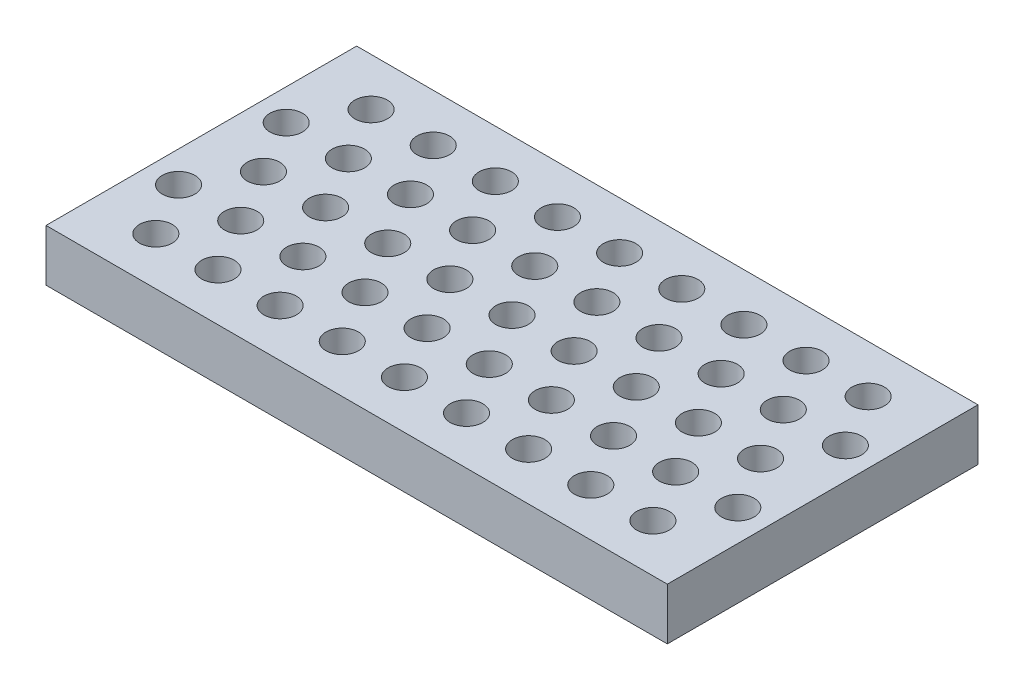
ISO-10303-21;
HEADER;
FILE_DESCRIPTION(('STEP AP214'),'2;1');
FILE_NAME('part.step','',(''),(''),'','','');
FILE_SCHEMA(('AUTOMOTIVE_DESIGN { 1 0 10303 214 1 1 1 1 }'));
ENDSEC;
DATA;
#1=APPLICATION_CONTEXT('core data for automotive mechanical design processes');
#2=APPLICATION_PROTOCOL_DEFINITION('international standard','automotive_design',2000,#1);
#3=PRODUCT_CONTEXT('',#1,'mechanical');
#4=PRODUCT('Part','Part','',(#3));
#5=PRODUCT_RELATED_PRODUCT_CATEGORY('part','',(#4));
#6=PRODUCT_DEFINITION_FORMATION('','',#4);
#7=PRODUCT_DEFINITION_CONTEXT('part definition',#1,'design');
#8=PRODUCT_DEFINITION('design','',#6,#7);
#9=PRODUCT_DEFINITION_SHAPE('','',#8);
#10=(LENGTH_UNIT() NAMED_UNIT(*) SI_UNIT(.MILLI.,.METRE.));
#11=(NAMED_UNIT(*) PLANE_ANGLE_UNIT() SI_UNIT($,.RADIAN.));
#12=(NAMED_UNIT(*) SI_UNIT($,.STERADIAN.) SOLID_ANGLE_UNIT());
#13=UNCERTAINTY_MEASURE_WITH_UNIT(LENGTH_MEASURE(1.E-05),#10,'distance_accuracy_value','');
#14=(GEOMETRIC_REPRESENTATION_CONTEXT(3) GLOBAL_UNCERTAINTY_ASSIGNED_CONTEXT((#13)) GLOBAL_UNIT_ASSIGNED_CONTEXT((#10,
#11,#12)) REPRESENTATION_CONTEXT('',''));
#15=CARTESIAN_POINT('',(0.,0.,0.));
#16=DIRECTION('',(0.,0.,1.));
#17=DIRECTION('',(1.,0.,0.));
#18=AXIS2_PLACEMENT_3D('',#15,#16,#17);
#19=CARTESIAN_POINT('',(-76.2,12.7,-38.1));
#20=DIRECTION('',(1.,0.,0.));
#21=DIRECTION('',(0.,0.,-1.));
#22=AXIS2_PLACEMENT_3D('',#19,#20,#21);
#23=PLANE('',#22);
#24=DIRECTION('',(0.,0.,1.));
#25=VECTOR('',#24,1.);
#26=CARTESIAN_POINT('',(-76.2,0.,-38.1));
#27=LINE('',#26,#25);
#28=CARTESIAN_POINT('',(-76.2,0.,-38.1));
#29=VERTEX_POINT('',#28);
#30=CARTESIAN_POINT('',(-76.2,0.,38.1));
#31=VERTEX_POINT('',#30);
#32=EDGE_CURVE('E97',#29,#31,#27,.T.);
#33=ORIENTED_EDGE('',*,*,#32,.T.);
#34=DIRECTION('',(0.,-1.,0.));
#35=VECTOR('',#34,1.);
#36=CARTESIAN_POINT('',(-76.2,12.7,38.1));
#37=LINE('',#36,#35);
#38=CARTESIAN_POINT('',(-76.2,12.7,38.1));
#39=VERTEX_POINT('',#38);
#40=EDGE_CURVE('E12',#39,#31,#37,.T.);
#41=ORIENTED_EDGE('',*,*,#40,.F.);
#42=DIRECTION('',(0.,0.,1.));
#43=VECTOR('',#42,1.);
#44=CARTESIAN_POINT('',(-76.2,12.7,-38.1));
#45=LINE('',#44,#43);
#46=CARTESIAN_POINT('',(-76.2,12.7,-38.1));
#47=VERTEX_POINT('',#46);
#48=EDGE_CURVE('E85',#47,#39,#45,.T.);
#49=ORIENTED_EDGE('',*,*,#48,.F.);
#50=DIRECTION('',(0.,-1.,0.));
#51=VECTOR('',#50,1.);
#52=CARTESIAN_POINT('',(-76.2,12.7,-38.1));
#53=LINE('',#52,#51);
#54=EDGE_CURVE('E93',#47,#29,#53,.T.);
#55=ORIENTED_EDGE('',*,*,#54,.T.);
#56=EDGE_LOOP('',(#33,#41,#49,#55));
#57=FACE_BOUND('',#56,.T.);
#58=ADVANCED_FACE('F34',(#57),#23,.F.);
#59=CARTESIAN_POINT('',(-76.2,12.7,38.1));
#60=DIRECTION('',(0.,0.,-1.));
#61=DIRECTION('',(-1.,0.,0.));
#62=AXIS2_PLACEMENT_3D('',#59,#60,#61);
#63=PLANE('',#62);
#64=DIRECTION('',(1.,0.,0.));
#65=VECTOR('',#64,1.);
#66=CARTESIAN_POINT('',(-76.2,0.,38.1));
#67=LINE('',#66,#65);
#68=CARTESIAN_POINT('',(76.2,0.,38.1));
#69=VERTEX_POINT('',#68);
#70=EDGE_CURVE('E89',#31,#69,#67,.T.);
#71=ORIENTED_EDGE('',*,*,#70,.T.);
#72=DIRECTION('',(0.,-1.,0.));
#73=VECTOR('',#72,1.);
#74=CARTESIAN_POINT('',(76.2,12.7,38.1));
#75=LINE('',#74,#73);
#76=CARTESIAN_POINT('',(76.2,12.7,38.1));
#77=VERTEX_POINT('',#76);
#78=EDGE_CURVE('E42',#77,#69,#75,.T.);
#79=ORIENTED_EDGE('',*,*,#78,.F.);
#80=DIRECTION('',(1.,0.,0.));
#81=VECTOR('',#80,1.);
#82=CARTESIAN_POINT('',(-76.2,12.7,38.1));
#83=LINE('',#82,#81);
#84=EDGE_CURVE('E80',#39,#77,#83,.T.);
#85=ORIENTED_EDGE('',*,*,#84,.F.);
#86=ORIENTED_EDGE('',*,*,#40,.T.);
#87=EDGE_LOOP('',(#71,#79,#85,#86));
#88=FACE_BOUND('',#87,.T.);
#89=ADVANCED_FACE('F88',(#88),#63,.F.);
#90=CARTESIAN_POINT('',(76.2,12.7,-38.1));
#91=DIRECTION('',(-1.,0.,0.));
#92=DIRECTION('',(0.,0.,1.));
#93=AXIS2_PLACEMENT_3D('',#90,#91,#92);
#94=PLANE('',#93);
#95=DIRECTION('',(0.,0.,-1.));
#96=VECTOR('',#95,1.);
#97=CARTESIAN_POINT('',(76.2,0.,-38.1));
#98=LINE('',#97,#96);
#99=CARTESIAN_POINT('',(76.2,0.,-38.1));
#100=VERTEX_POINT('',#99);
#101=EDGE_CURVE('E67',#69,#100,#98,.T.);
#102=ORIENTED_EDGE('',*,*,#101,.T.);
#103=DIRECTION('',(0.,-1.,0.));
#104=VECTOR('',#103,1.);
#105=CARTESIAN_POINT('',(76.2,12.7,-38.1));
#106=LINE('',#105,#104);
#107=CARTESIAN_POINT('',(76.2,12.7,-38.1));
#108=VERTEX_POINT('',#107);
#109=EDGE_CURVE('E90',#108,#100,#106,.T.);
#110=ORIENTED_EDGE('',*,*,#109,.F.);
#111=DIRECTION('',(0.,0.,-1.));
#112=VECTOR('',#111,1.);
#113=CARTESIAN_POINT('',(76.2,12.7,-38.1));
#114=LINE('',#113,#112);
#115=EDGE_CURVE('E83',#77,#108,#114,.T.);
#116=ORIENTED_EDGE('',*,*,#115,.F.);
#117=ORIENTED_EDGE('',*,*,#78,.T.);
#118=EDGE_LOOP('',(#102,#110,#116,#117));
#119=FACE_BOUND('',#118,.T.);
#120=ADVANCED_FACE('F91',(#119),#94,.F.);
#121=CARTESIAN_POINT('',(-76.2,12.7,-38.1));
#122=DIRECTION('',(0.,0.,1.));
#123=DIRECTION('',(1.,0.,0.));
#124=AXIS2_PLACEMENT_3D('',#121,#122,#123);
#125=PLANE('',#124);
#126=DIRECTION('',(-1.,0.,0.));
#127=VECTOR('',#126,1.);
#128=CARTESIAN_POINT('',(-76.2,0.,-38.1));
#129=LINE('',#128,#127);
#130=EDGE_CURVE('E73',#100,#29,#129,.T.);
#131=ORIENTED_EDGE('',*,*,#130,.T.);
#132=ORIENTED_EDGE('',*,*,#54,.F.);
#133=DIRECTION('',(-1.,0.,0.));
#134=VECTOR('',#133,1.);
#135=CARTESIAN_POINT('',(-76.2,12.7,-38.1));
#136=LINE('',#135,#134);
#137=EDGE_CURVE('E50',#108,#47,#136,.T.);
#138=ORIENTED_EDGE('',*,*,#137,.F.);
#139=ORIENTED_EDGE('',*,*,#109,.T.);
#140=EDGE_LOOP('',(#131,#132,#138,#139));
#141=FACE_BOUND('',#140,.T.);
#142=ADVANCED_FACE('F105',(#141),#125,.F.);
#143=CARTESIAN_POINT('',(-76.2,12.7,38.1));
#144=DIRECTION('',(0.,1.,0.));
#145=DIRECTION('',(0.,0.,1.));
#146=AXIS2_PLACEMENT_3D('',#143,#144,#145);
#147=PLANE('',#146);
#148=CARTESIAN_POINT('',(60.9599999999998,12.7,-26.3964543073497));
#149=DIRECTION('',(0.,1.,0.));
#150=DIRECTION('',(1.,0.,0.));
#151=AXIS2_PLACEMENT_3D('',#148,#149,#150);
#152=CIRCLE('',#151,4.);
#153=CARTESIAN_POINT('',(64.9599999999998,12.7,-26.3964543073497));
#154=VERTEX_POINT('',#153);
#155=EDGE_CURVE('E387',#154,#154,#152,.T.);
#156=ORIENTED_EDGE('',*,*,#155,.F.);
#157=EDGE_LOOP('',(#156));
#158=FACE_BOUND('',#157,.T.);
#159=CARTESIAN_POINT('',(45.7199999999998,12.7,-26.3964543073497));
#160=DIRECTION('',(0.,1.,0.));
#161=DIRECTION('',(1.,0.,0.));
#162=AXIS2_PLACEMENT_3D('',#159,#160,#161);
#163=CIRCLE('',#162,4.);
#164=CARTESIAN_POINT('',(49.7199999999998,12.7,-26.3964543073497));
#165=VERTEX_POINT('',#164);
#166=EDGE_CURVE('E381',#165,#165,#163,.T.);
#167=ORIENTED_EDGE('',*,*,#166,.F.);
#168=EDGE_LOOP('',(#167));
#169=FACE_BOUND('',#168,.T.);
#170=CARTESIAN_POINT('',(30.4799999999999,12.7,-26.3964543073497));
#171=DIRECTION('',(0.,1.,0.));
#172=DIRECTION('',(1.,0.,0.));
#173=AXIS2_PLACEMENT_3D('',#170,#171,#172);
#174=CIRCLE('',#173,4.);
#175=CARTESIAN_POINT('',(34.4799999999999,12.7,-26.3964543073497));
#176=VERTEX_POINT('',#175);
#177=EDGE_CURVE('E375',#176,#176,#174,.T.);
#178=ORIENTED_EDGE('',*,*,#177,.F.);
#179=EDGE_LOOP('',(#178));
#180=FACE_BOUND('',#179,.T.);
#181=CARTESIAN_POINT('',(15.2399999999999,12.7,-26.3964543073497));
#182=DIRECTION('',(0.,1.,0.));
#183=DIRECTION('',(1.,0.,0.));
#184=AXIS2_PLACEMENT_3D('',#181,#182,#183);
#185=CIRCLE('',#184,4.);
#186=CARTESIAN_POINT('',(19.2399999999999,12.7,-26.3964543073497));
#187=VERTEX_POINT('',#186);
#188=EDGE_CURVE('E369',#187,#187,#185,.T.);
#189=ORIENTED_EDGE('',*,*,#188,.F.);
#190=EDGE_LOOP('',(#189));
#191=FACE_BOUND('',#190,.T.);
#192=CARTESIAN_POINT('',(0.,12.7,-26.3964543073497));
#193=DIRECTION('',(0.,1.,0.));
#194=DIRECTION('',(1.,0.,0.));
#195=AXIS2_PLACEMENT_3D('',#192,#193,#194);
#196=CIRCLE('',#195,4.);
#197=CARTESIAN_POINT('',(4.00000000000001,12.7,-26.3964543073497));
#198=VERTEX_POINT('',#197);
#199=EDGE_CURVE('E363',#198,#198,#196,.T.);
#200=ORIENTED_EDGE('',*,*,#199,.F.);
#201=EDGE_LOOP('',(#200));
#202=FACE_BOUND('',#201,.T.);
#203=CARTESIAN_POINT('',(-15.2399999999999,12.7,-26.3964543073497));
#204=DIRECTION('',(0.,1.,0.));
#205=DIRECTION('',(1.,0.,0.));
#206=AXIS2_PLACEMENT_3D('',#203,#204,#205);
#207=CIRCLE('',#206,4.);
#208=CARTESIAN_POINT('',(-11.2399999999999,12.7,-26.3964543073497));
#209=VERTEX_POINT('',#208);
#210=EDGE_CURVE('E357',#209,#209,#207,.T.);
#211=ORIENTED_EDGE('',*,*,#210,.F.);
#212=EDGE_LOOP('',(#211));
#213=FACE_BOUND('',#212,.T.);
#214=CARTESIAN_POINT('',(-30.4799999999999,12.7,-26.3964543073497));
#215=DIRECTION('',(0.,1.,0.));
#216=DIRECTION('',(1.,0.,0.));
#217=AXIS2_PLACEMENT_3D('',#214,#215,#216);
#218=CIRCLE('',#217,4.);
#219=CARTESIAN_POINT('',(-26.4799999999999,12.7,-26.3964543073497));
#220=VERTEX_POINT('',#219);
#221=EDGE_CURVE('E351',#220,#220,#218,.T.);
#222=ORIENTED_EDGE('',*,*,#221,.F.);
#223=EDGE_LOOP('',(#222));
#224=FACE_BOUND('',#223,.T.);
#225=CARTESIAN_POINT('',(68.5799999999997,12.7,-13.1982271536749));
#226=DIRECTION('',(0.,1.,0.));
#227=DIRECTION('',(1.,0.,0.));
#228=AXIS2_PLACEMENT_3D('',#225,#226,#227);
#229=CIRCLE('',#228,4.);
#230=CARTESIAN_POINT('',(72.5799999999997,12.7,-13.1982271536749));
#231=VERTEX_POINT('',#230);
#232=EDGE_CURVE('E345',#231,#231,#229,.T.);
#233=ORIENTED_EDGE('',*,*,#232,.F.);
#234=EDGE_LOOP('',(#233));
#235=FACE_BOUND('',#234,.T.);
#236=CARTESIAN_POINT('',(53.3399999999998,12.7,-13.1982271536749));
#237=DIRECTION('',(0.,1.,0.));
#238=DIRECTION('',(1.,0.,0.));
#239=AXIS2_PLACEMENT_3D('',#236,#237,#238);
#240=CIRCLE('',#239,4.);
#241=CARTESIAN_POINT('',(57.3399999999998,12.7,-13.1982271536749));
#242=VERTEX_POINT('',#241);
#243=EDGE_CURVE('E339',#242,#242,#240,.T.);
#244=ORIENTED_EDGE('',*,*,#243,.F.);
#245=EDGE_LOOP('',(#244));
#246=FACE_BOUND('',#245,.T.);
#247=CARTESIAN_POINT('',(38.0999999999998,12.7,-13.1982271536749));
#248=DIRECTION('',(0.,1.,0.));
#249=DIRECTION('',(1.,0.,0.));
#250=AXIS2_PLACEMENT_3D('',#247,#248,#249);
#251=CIRCLE('',#250,4.);
#252=CARTESIAN_POINT('',(42.0999999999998,12.7,-13.1982271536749));
#253=VERTEX_POINT('',#252);
#254=EDGE_CURVE('E333',#253,#253,#251,.T.);
#255=ORIENTED_EDGE('',*,*,#254,.F.);
#256=EDGE_LOOP('',(#255));
#257=FACE_BOUND('',#256,.T.);
#258=CARTESIAN_POINT('',(22.8599999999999,12.7,-13.1982271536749));
#259=DIRECTION('',(0.,1.,0.));
#260=DIRECTION('',(1.,0.,0.));
#261=AXIS2_PLACEMENT_3D('',#258,#259,#260);
#262=CIRCLE('',#261,4.);
#263=CARTESIAN_POINT('',(26.8599999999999,12.7,-13.1982271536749));
#264=VERTEX_POINT('',#263);
#265=EDGE_CURVE('E327',#264,#264,#262,.T.);
#266=ORIENTED_EDGE('',*,*,#265,.F.);
#267=EDGE_LOOP('',(#266));
#268=FACE_BOUND('',#267,.T.);
#269=CARTESIAN_POINT('',(7.61999999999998,12.7,-13.1982271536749));
#270=DIRECTION('',(0.,1.,0.));
#271=DIRECTION('',(1.,0.,0.));
#272=AXIS2_PLACEMENT_3D('',#269,#270,#271);
#273=CIRCLE('',#272,4.);
#274=CARTESIAN_POINT('',(11.62,12.7,-13.1982271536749));
#275=VERTEX_POINT('',#274);
#276=EDGE_CURVE('E321',#275,#275,#273,.T.);
#277=ORIENTED_EDGE('',*,*,#276,.F.);
#278=EDGE_LOOP('',(#277));
#279=FACE_BOUND('',#278,.T.);
#280=CARTESIAN_POINT('',(-7.61999999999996,12.7,-13.1982271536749));
#281=DIRECTION('',(0.,1.,0.));
#282=DIRECTION('',(1.,0.,0.));
#283=AXIS2_PLACEMENT_3D('',#280,#281,#282);
#284=CIRCLE('',#283,4.);
#285=CARTESIAN_POINT('',(-3.61999999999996,12.7,-13.1982271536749));
#286=VERTEX_POINT('',#285);
#287=EDGE_CURVE('E315',#286,#286,#284,.T.);
#288=ORIENTED_EDGE('',*,*,#287,.F.);
#289=EDGE_LOOP('',(#288));
#290=FACE_BOUND('',#289,.T.);
#291=CARTESIAN_POINT('',(-22.8599999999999,12.7,-13.1982271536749));
#292=DIRECTION('',(0.,1.,0.));
#293=DIRECTION('',(1.,0.,0.));
#294=AXIS2_PLACEMENT_3D('',#291,#292,#293);
#295=CIRCLE('',#294,4.);
#296=CARTESIAN_POINT('',(-18.8599999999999,12.7,-13.1982271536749));
#297=VERTEX_POINT('',#296);
#298=EDGE_CURVE('E309',#297,#297,#295,.T.);
#299=ORIENTED_EDGE('',*,*,#298,.F.);
#300=EDGE_LOOP('',(#299));
#301=FACE_BOUND('',#300,.T.);
#302=CARTESIAN_POINT('',(-38.0999999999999,12.7,-13.1982271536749));
#303=DIRECTION('',(0.,1.,0.));
#304=DIRECTION('',(1.,0.,0.));
#305=AXIS2_PLACEMENT_3D('',#302,#303,#304);
#306=CIRCLE('',#305,4.);
#307=CARTESIAN_POINT('',(-34.0999999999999,12.7,-13.1982271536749));
#308=VERTEX_POINT('',#307);
#309=EDGE_CURVE('E303',#308,#308,#306,.T.);
#310=ORIENTED_EDGE('',*,*,#309,.F.);
#311=EDGE_LOOP('',(#310));
#312=FACE_BOUND('',#311,.T.);
#313=CARTESIAN_POINT('',(-45.7199999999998,12.7,-26.3964543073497));
#314=DIRECTION('',(0.,1.,0.));
#315=DIRECTION('',(1.,0.,0.));
#316=AXIS2_PLACEMENT_3D('',#313,#314,#315);
#317=CIRCLE('',#316,4.);
#318=CARTESIAN_POINT('',(-41.7199999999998,12.7,-26.3964543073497));
#319=VERTEX_POINT('',#318);
#320=EDGE_CURVE('E297',#319,#319,#317,.T.);
#321=ORIENTED_EDGE('',*,*,#320,.F.);
#322=EDGE_LOOP('',(#321));
#323=FACE_BOUND('',#322,.T.);
#324=CARTESIAN_POINT('',(60.9599999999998,12.7,0.));
#325=DIRECTION('',(0.,1.,0.));
#326=DIRECTION('',(1.,0.,0.));
#327=AXIS2_PLACEMENT_3D('',#324,#325,#326);
#328=CIRCLE('',#327,4.);
#329=CARTESIAN_POINT('',(64.9599999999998,12.7,0.));
#330=VERTEX_POINT('',#329);
#331=EDGE_CURVE('E291',#330,#330,#328,.T.);
#332=ORIENTED_EDGE('',*,*,#331,.F.);
#333=EDGE_LOOP('',(#332));
#334=FACE_BOUND('',#333,.T.);
#335=CARTESIAN_POINT('',(45.7199999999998,12.7,0.));
#336=DIRECTION('',(0.,1.,0.));
#337=DIRECTION('',(1.,0.,0.));
#338=AXIS2_PLACEMENT_3D('',#335,#336,#337);
#339=CIRCLE('',#338,4.);
#340=CARTESIAN_POINT('',(49.7199999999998,12.7,0.));
#341=VERTEX_POINT('',#340);
#342=EDGE_CURVE('E285',#341,#341,#339,.T.);
#343=ORIENTED_EDGE('',*,*,#342,.F.);
#344=EDGE_LOOP('',(#343));
#345=FACE_BOUND('',#344,.T.);
#346=CARTESIAN_POINT('',(30.4799999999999,12.7,0.));
#347=DIRECTION('',(0.,1.,0.));
#348=DIRECTION('',(1.,0.,0.));
#349=AXIS2_PLACEMENT_3D('',#346,#347,#348);
#350=CIRCLE('',#349,4.);
#351=CARTESIAN_POINT('',(34.4799999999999,12.7,0.));
#352=VERTEX_POINT('',#351);
#353=EDGE_CURVE('E279',#352,#352,#350,.T.);
#354=ORIENTED_EDGE('',*,*,#353,.F.);
#355=EDGE_LOOP('',(#354));
#356=FACE_BOUND('',#355,.T.);
#357=CARTESIAN_POINT('',(15.2399999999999,12.7,0.));
#358=DIRECTION('',(0.,1.,0.));
#359=DIRECTION('',(1.,0.,0.));
#360=AXIS2_PLACEMENT_3D('',#357,#358,#359);
#361=CIRCLE('',#360,4.);
#362=CARTESIAN_POINT('',(19.2399999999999,12.7,0.));
#363=VERTEX_POINT('',#362);
#364=EDGE_CURVE('E273',#363,#363,#361,.T.);
#365=ORIENTED_EDGE('',*,*,#364,.F.);
#366=EDGE_LOOP('',(#365));
#367=FACE_BOUND('',#366,.T.);
#368=CARTESIAN_POINT('',(0.,12.7,0.));
#369=DIRECTION('',(0.,1.,0.));
#370=DIRECTION('',(1.,0.,0.));
#371=AXIS2_PLACEMENT_3D('',#368,#369,#370);
#372=CIRCLE('',#371,4.);
#373=CARTESIAN_POINT('',(4.00000000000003,12.7,0.));
#374=VERTEX_POINT('',#373);
#375=EDGE_CURVE('E267',#374,#374,#372,.T.);
#376=ORIENTED_EDGE('',*,*,#375,.F.);
#377=EDGE_LOOP('',(#376));
#378=FACE_BOUND('',#377,.T.);
#379=CARTESIAN_POINT('',(-15.2399999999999,12.7,0.));
#380=DIRECTION('',(0.,1.,0.));
#381=DIRECTION('',(1.,0.,0.));
#382=AXIS2_PLACEMENT_3D('',#379,#380,#381);
#383=CIRCLE('',#382,4.);
#384=CARTESIAN_POINT('',(-11.2399999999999,12.7,0.));
#385=VERTEX_POINT('',#384);
#386=EDGE_CURVE('E261',#385,#385,#383,.T.);
#387=ORIENTED_EDGE('',*,*,#386,.F.);
#388=EDGE_LOOP('',(#387));
#389=FACE_BOUND('',#388,.T.);
#390=CARTESIAN_POINT('',(-30.4799999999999,12.7,0.));
#391=DIRECTION('',(0.,1.,0.));
#392=DIRECTION('',(1.,0.,0.));
#393=AXIS2_PLACEMENT_3D('',#390,#391,#392);
#394=CIRCLE('',#393,4.);
#395=CARTESIAN_POINT('',(-26.4799999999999,12.7,0.));
#396=VERTEX_POINT('',#395);
#397=EDGE_CURVE('E255',#396,#396,#394,.T.);
#398=ORIENTED_EDGE('',*,*,#397,.F.);
#399=EDGE_LOOP('',(#398));
#400=FACE_BOUND('',#399,.T.);
#401=CARTESIAN_POINT('',(-45.7199999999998,12.7,0.));
#402=DIRECTION('',(0.,1.,0.));
#403=DIRECTION('',(1.,0.,0.));
#404=AXIS2_PLACEMENT_3D('',#401,#402,#403);
#405=CIRCLE('',#404,4.);
#406=CARTESIAN_POINT('',(-41.7199999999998,12.7,0.));
#407=VERTEX_POINT('',#406);
#408=EDGE_CURVE('E249',#407,#407,#405,.T.);
#409=ORIENTED_EDGE('',*,*,#408,.F.);
#410=EDGE_LOOP('',(#409));
#411=FACE_BOUND('',#410,.T.);
#412=CARTESIAN_POINT('',(-53.3399999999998,12.7,-13.1982271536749));
#413=DIRECTION('',(0.,1.,0.));
#414=DIRECTION('',(1.,0.,0.));
#415=AXIS2_PLACEMENT_3D('',#412,#413,#414);
#416=CIRCLE('',#415,4.);
#417=CARTESIAN_POINT('',(-49.3399999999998,12.7,-13.1982271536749));
#418=VERTEX_POINT('',#417);
#419=EDGE_CURVE('E243',#418,#418,#416,.T.);
#420=ORIENTED_EDGE('',*,*,#419,.F.);
#421=EDGE_LOOP('',(#420));
#422=FACE_BOUND('',#421,.T.);
#423=CARTESIAN_POINT('',(68.5799999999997,12.7,13.1982271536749));
#424=DIRECTION('',(0.,1.,0.));
#425=DIRECTION('',(1.,0.,0.));
#426=AXIS2_PLACEMENT_3D('',#423,#424,#425);
#427=CIRCLE('',#426,4.);
#428=CARTESIAN_POINT('',(72.5799999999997,12.7,13.1982271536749));
#429=VERTEX_POINT('',#428);
#430=EDGE_CURVE('E237',#429,#429,#427,.T.);
#431=ORIENTED_EDGE('',*,*,#430,.F.);
#432=EDGE_LOOP('',(#431));
#433=FACE_BOUND('',#432,.T.);
#434=CARTESIAN_POINT('',(53.3399999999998,12.7,13.1982271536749));
#435=DIRECTION('',(0.,1.,0.));
#436=DIRECTION('',(1.,0.,0.));
#437=AXIS2_PLACEMENT_3D('',#434,#435,#436);
#438=CIRCLE('',#437,4.);
#439=CARTESIAN_POINT('',(57.3399999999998,12.7,13.1982271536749));
#440=VERTEX_POINT('',#439);
#441=EDGE_CURVE('E231',#440,#440,#438,.T.);
#442=ORIENTED_EDGE('',*,*,#441,.F.);
#443=EDGE_LOOP('',(#442));
#444=FACE_BOUND('',#443,.T.);
#445=CARTESIAN_POINT('',(38.0999999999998,12.7,13.1982271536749));
#446=DIRECTION('',(0.,1.,0.));
#447=DIRECTION('',(1.,0.,0.));
#448=AXIS2_PLACEMENT_3D('',#445,#446,#447);
#449=CIRCLE('',#448,4.);
#450=CARTESIAN_POINT('',(42.0999999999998,12.7,13.1982271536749));
#451=VERTEX_POINT('',#450);
#452=EDGE_CURVE('E225',#451,#451,#449,.T.);
#453=ORIENTED_EDGE('',*,*,#452,.F.);
#454=EDGE_LOOP('',(#453));
#455=FACE_BOUND('',#454,.T.);
#456=CARTESIAN_POINT('',(22.8599999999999,12.7,13.1982271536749));
#457=DIRECTION('',(0.,1.,0.));
#458=DIRECTION('',(1.,0.,0.));
#459=AXIS2_PLACEMENT_3D('',#456,#457,#458);
#460=CIRCLE('',#459,4.);
#461=CARTESIAN_POINT('',(26.8599999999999,12.7,13.1982271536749));
#462=VERTEX_POINT('',#461);
#463=EDGE_CURVE('E219',#462,#462,#460,.T.);
#464=ORIENTED_EDGE('',*,*,#463,.F.);
#465=EDGE_LOOP('',(#464));
#466=FACE_BOUND('',#465,.T.);
#467=CARTESIAN_POINT('',(7.61999999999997,12.7,13.1982271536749));
#468=DIRECTION('',(0.,1.,0.));
#469=DIRECTION('',(1.,0.,0.));
#470=AXIS2_PLACEMENT_3D('',#467,#468,#469);
#471=CIRCLE('',#470,4.);
#472=CARTESIAN_POINT('',(11.62,12.7,13.1982271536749));
#473=VERTEX_POINT('',#472);
#474=EDGE_CURVE('E213',#473,#473,#471,.T.);
#475=ORIENTED_EDGE('',*,*,#474,.F.);
#476=EDGE_LOOP('',(#475));
#477=FACE_BOUND('',#476,.T.);
#478=CARTESIAN_POINT('',(-7.61999999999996,12.7,13.1982271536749));
#479=DIRECTION('',(0.,1.,0.));
#480=DIRECTION('',(1.,0.,0.));
#481=AXIS2_PLACEMENT_3D('',#478,#479,#480);
#482=CIRCLE('',#481,4.);
#483=CARTESIAN_POINT('',(-3.61999999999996,12.7,13.1982271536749));
#484=VERTEX_POINT('',#483);
#485=EDGE_CURVE('E207',#484,#484,#482,.T.);
#486=ORIENTED_EDGE('',*,*,#485,.F.);
#487=EDGE_LOOP('',(#486));
#488=FACE_BOUND('',#487,.T.);
#489=CARTESIAN_POINT('',(-22.8599999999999,12.7,13.1982271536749));
#490=DIRECTION('',(0.,1.,0.));
#491=DIRECTION('',(1.,0.,0.));
#492=AXIS2_PLACEMENT_3D('',#489,#490,#491);
#493=CIRCLE('',#492,4.);
#494=CARTESIAN_POINT('',(-18.8599999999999,12.7,13.1982271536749));
#495=VERTEX_POINT('',#494);
#496=EDGE_CURVE('E201',#495,#495,#493,.T.);
#497=ORIENTED_EDGE('',*,*,#496,.F.);
#498=EDGE_LOOP('',(#497));
#499=FACE_BOUND('',#498,.T.);
#500=CARTESIAN_POINT('',(-38.0999999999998,12.7,13.1982271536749));
#501=DIRECTION('',(0.,1.,0.));
#502=DIRECTION('',(1.,0.,0.));
#503=AXIS2_PLACEMENT_3D('',#500,#501,#502);
#504=CIRCLE('',#503,4.);
#505=CARTESIAN_POINT('',(-34.0999999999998,12.7,13.1982271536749));
#506=VERTEX_POINT('',#505);
#507=EDGE_CURVE('E195',#506,#506,#504,.T.);
#508=ORIENTED_EDGE('',*,*,#507,.F.);
#509=EDGE_LOOP('',(#508));
#510=FACE_BOUND('',#509,.T.);
#511=CARTESIAN_POINT('',(-53.3399999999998,12.7,13.1982271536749));
#512=DIRECTION('',(0.,1.,0.));
#513=DIRECTION('',(1.,0.,0.));
#514=AXIS2_PLACEMENT_3D('',#511,#512,#513);
#515=CIRCLE('',#514,4.);
#516=CARTESIAN_POINT('',(-49.3399999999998,12.7,13.1982271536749));
#517=VERTEX_POINT('',#516);
#518=EDGE_CURVE('E189',#517,#517,#515,.T.);
#519=ORIENTED_EDGE('',*,*,#518,.F.);
#520=EDGE_LOOP('',(#519));
#521=FACE_BOUND('',#520,.T.);
#522=CARTESIAN_POINT('',(-60.9599999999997,12.7,0.));
#523=DIRECTION('',(0.,1.,0.));
#524=DIRECTION('',(1.,0.,0.));
#525=AXIS2_PLACEMENT_3D('',#522,#523,#524);
#526=CIRCLE('',#525,4.);
#527=CARTESIAN_POINT('',(-56.9599999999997,12.7,0.));
#528=VERTEX_POINT('',#527);
#529=EDGE_CURVE('E183',#528,#528,#526,.T.);
#530=ORIENTED_EDGE('',*,*,#529,.F.);
#531=EDGE_LOOP('',(#530));
#532=FACE_BOUND('',#531,.T.);
#533=CARTESIAN_POINT('',(-60.9599999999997,12.7,-26.3964543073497));
#534=DIRECTION('',(0.,1.,0.));
#535=DIRECTION('',(1.,0.,0.));
#536=AXIS2_PLACEMENT_3D('',#533,#534,#535);
#537=CIRCLE('',#536,4.);
#538=CARTESIAN_POINT('',(-56.9599999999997,12.7,-26.3964543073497));
#539=VERTEX_POINT('',#538);
#540=EDGE_CURVE('E177',#539,#539,#537,.T.);
#541=ORIENTED_EDGE('',*,*,#540,.F.);
#542=EDGE_LOOP('',(#541));
#543=FACE_BOUND('',#542,.T.);
#544=CARTESIAN_POINT('',(60.9599999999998,12.7,26.3964543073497));
#545=DIRECTION('',(0.,1.,0.));
#546=DIRECTION('',(1.,0.,0.));
#547=AXIS2_PLACEMENT_3D('',#544,#545,#546);
#548=CIRCLE('',#547,4.);
#549=CARTESIAN_POINT('',(64.9599999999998,12.7,26.3964543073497));
#550=VERTEX_POINT('',#549);
#551=EDGE_CURVE('E171',#550,#550,#548,.T.);
#552=ORIENTED_EDGE('',*,*,#551,.F.);
#553=EDGE_LOOP('',(#552));
#554=FACE_BOUND('',#553,.T.);
#555=CARTESIAN_POINT('',(45.7199999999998,12.7,26.3964543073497));
#556=DIRECTION('',(0.,1.,0.));
#557=DIRECTION('',(1.,0.,0.));
#558=AXIS2_PLACEMENT_3D('',#555,#556,#557);
#559=CIRCLE('',#558,4.);
#560=CARTESIAN_POINT('',(49.7199999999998,12.7,26.3964543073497));
#561=VERTEX_POINT('',#560);
#562=EDGE_CURVE('E165',#561,#561,#559,.T.);
#563=ORIENTED_EDGE('',*,*,#562,.F.);
#564=EDGE_LOOP('',(#563));
#565=FACE_BOUND('',#564,.T.);
#566=CARTESIAN_POINT('',(30.4799999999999,12.7,26.3964543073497));
#567=DIRECTION('',(0.,1.,0.));
#568=DIRECTION('',(1.,0.,0.));
#569=AXIS2_PLACEMENT_3D('',#566,#567,#568);
#570=CIRCLE('',#569,4.);
#571=CARTESIAN_POINT('',(34.4799999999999,12.7,26.3964543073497));
#572=VERTEX_POINT('',#571);
#573=EDGE_CURVE('E159',#572,#572,#570,.T.);
#574=ORIENTED_EDGE('',*,*,#573,.F.);
#575=EDGE_LOOP('',(#574));
#576=FACE_BOUND('',#575,.T.);
#577=CARTESIAN_POINT('',(15.2399999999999,12.7,26.3964543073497));
#578=DIRECTION('',(0.,1.,0.));
#579=DIRECTION('',(1.,0.,0.));
#580=AXIS2_PLACEMENT_3D('',#577,#578,#579);
#581=CIRCLE('',#580,4.);
#582=CARTESIAN_POINT('',(19.2399999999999,12.7,26.3964543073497));
#583=VERTEX_POINT('',#582);
#584=EDGE_CURVE('E153',#583,#583,#581,.T.);
#585=ORIENTED_EDGE('',*,*,#584,.F.);
#586=EDGE_LOOP('',(#585));
#587=FACE_BOUND('',#586,.T.);
#588=CARTESIAN_POINT('',(0.,12.7,26.3964543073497));
#589=DIRECTION('',(0.,1.,0.));
#590=DIRECTION('',(1.,0.,0.));
#591=AXIS2_PLACEMENT_3D('',#588,#589,#590);
#592=CIRCLE('',#591,4.);
#593=CARTESIAN_POINT('',(4.00000000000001,12.7,26.3964543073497));
#594=VERTEX_POINT('',#593);
#595=EDGE_CURVE('E147',#594,#594,#592,.T.);
#596=ORIENTED_EDGE('',*,*,#595,.F.);
#597=EDGE_LOOP('',(#596));
#598=FACE_BOUND('',#597,.T.);
#599=CARTESIAN_POINT('',(-15.2399999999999,12.7,26.3964543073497));
#600=DIRECTION('',(0.,1.,0.));
#601=DIRECTION('',(1.,0.,0.));
#602=AXIS2_PLACEMENT_3D('',#599,#600,#601);
#603=CIRCLE('',#602,4.);
#604=CARTESIAN_POINT('',(-11.2399999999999,12.7,26.3964543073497));
#605=VERTEX_POINT('',#604);
#606=EDGE_CURVE('E141',#605,#605,#603,.T.);
#607=ORIENTED_EDGE('',*,*,#606,.F.);
#608=EDGE_LOOP('',(#607));
#609=FACE_BOUND('',#608,.T.);
#610=CARTESIAN_POINT('',(-30.4799999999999,12.7,26.3964543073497));
#611=DIRECTION('',(0.,1.,0.));
#612=DIRECTION('',(1.,0.,0.));
#613=AXIS2_PLACEMENT_3D('',#610,#611,#612);
#614=CIRCLE('',#613,4.);
#615=CARTESIAN_POINT('',(-26.4799999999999,12.7,26.3964543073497));
#616=VERTEX_POINT('',#615);
#617=EDGE_CURVE('E135',#616,#616,#614,.T.);
#618=ORIENTED_EDGE('',*,*,#617,.F.);
#619=EDGE_LOOP('',(#618));
#620=FACE_BOUND('',#619,.T.);
#621=CARTESIAN_POINT('',(-45.7199999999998,12.7,26.3964543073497));
#622=DIRECTION('',(0.,1.,0.));
#623=DIRECTION('',(1.,0.,0.));
#624=AXIS2_PLACEMENT_3D('',#621,#622,#623);
#625=CIRCLE('',#624,4.);
#626=CARTESIAN_POINT('',(-41.7199999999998,12.7,26.3964543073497));
#627=VERTEX_POINT('',#626);
#628=EDGE_CURVE('E129',#627,#627,#625,.T.);
#629=ORIENTED_EDGE('',*,*,#628,.F.);
#630=EDGE_LOOP('',(#629));
#631=FACE_BOUND('',#630,.T.);
#632=CARTESIAN_POINT('',(-60.9599999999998,12.7,26.3964543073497));
#633=DIRECTION('',(0.,1.,0.));
#634=DIRECTION('',(1.,0.,0.));
#635=AXIS2_PLACEMENT_3D('',#632,#633,#634);
#636=CIRCLE('',#635,4.);
#637=CARTESIAN_POINT('',(-56.9599999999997,12.7,26.3964543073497));
#638=VERTEX_POINT('',#637);
#639=EDGE_CURVE('E123',#638,#638,#636,.T.);
#640=ORIENTED_EDGE('',*,*,#639,.F.);
#641=EDGE_LOOP('',(#640));
#642=FACE_BOUND('',#641,.T.);
#643=CARTESIAN_POINT('',(-68.5799999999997,12.7,13.1982271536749));
#644=DIRECTION('',(0.,1.,0.));
#645=DIRECTION('',(1.,0.,0.));
#646=AXIS2_PLACEMENT_3D('',#643,#644,#645);
#647=CIRCLE('',#646,4.);
#648=CARTESIAN_POINT('',(-64.5799999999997,12.7,13.1982271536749));
#649=VERTEX_POINT('',#648);
#650=EDGE_CURVE('E117',#649,#649,#647,.T.);
#651=ORIENTED_EDGE('',*,*,#650,.F.);
#652=EDGE_LOOP('',(#651));
#653=FACE_BOUND('',#652,.T.);
#654=CARTESIAN_POINT('',(-68.5799999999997,12.7,-13.1982271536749));
#655=DIRECTION('',(0.,1.,0.));
#656=DIRECTION('',(1.,0.,0.));
#657=AXIS2_PLACEMENT_3D('',#654,#655,#656);
#658=CIRCLE('',#657,4.);
#659=CARTESIAN_POINT('',(-64.5799999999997,12.7,-13.1982271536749));
#660=VERTEX_POINT('',#659);
#661=EDGE_CURVE('E111',#660,#660,#658,.T.);
#662=ORIENTED_EDGE('',*,*,#661,.F.);
#663=EDGE_LOOP('',(#662));
#664=FACE_BOUND('',#663,.T.);
#665=ORIENTED_EDGE('',*,*,#48,.T.);
#666=ORIENTED_EDGE('',*,*,#84,.T.);
#667=ORIENTED_EDGE('',*,*,#115,.T.);
#668=ORIENTED_EDGE('',*,*,#137,.T.);
#669=EDGE_LOOP('',(#665,#666,#667,#668));
#670=FACE_BOUND('',#669,.T.);
#671=ADVANCED_FACE('F81',(#158,#169,#180,#191,#202,#213,#224,#235,#246,#257,#268,#279,#290,#301,
#312,#323,#334,#345,#356,#367,#378,#389,#400,#411,#422,#433,#444,#455,#466,#477,#488,#499,#510,
#521,#532,#543,#554,#565,#576,#587,#598,#609,#620,#631,#642,#653,#664,#670),#147,.T.);
#672=CARTESIAN_POINT('',(-76.2,0.,38.1));
#673=DIRECTION('',(0.,1.,0.));
#674=DIRECTION('',(0.,0.,1.));
#675=AXIS2_PLACEMENT_3D('',#672,#673,#674);
#676=PLANE('',#675);
#677=CARTESIAN_POINT('',(60.9599999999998,0.,-26.3964543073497));
#678=DIRECTION('',(0.,1.,0.));
#679=DIRECTION('',(1.,0.,0.));
#680=AXIS2_PLACEMENT_3D('',#677,#678,#679);
#681=CIRCLE('',#680,4.);
#682=CARTESIAN_POINT('',(64.9599999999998,0.,-26.3964543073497));
#683=VERTEX_POINT('',#682);
#684=EDGE_CURVE('E384',#683,#683,#681,.T.);
#685=ORIENTED_EDGE('',*,*,#684,.T.);
#686=EDGE_LOOP('',(#685));
#687=FACE_BOUND('',#686,.T.);
#688=CARTESIAN_POINT('',(45.7199999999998,0.,-26.3964543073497));
#689=DIRECTION('',(0.,1.,0.));
#690=DIRECTION('',(1.,0.,0.));
#691=AXIS2_PLACEMENT_3D('',#688,#689,#690);
#692=CIRCLE('',#691,4.);
#693=CARTESIAN_POINT('',(49.7199999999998,0.,-26.3964543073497));
#694=VERTEX_POINT('',#693);
#695=EDGE_CURVE('E378',#694,#694,#692,.T.);
#696=ORIENTED_EDGE('',*,*,#695,.T.);
#697=EDGE_LOOP('',(#696));
#698=FACE_BOUND('',#697,.T.);
#699=CARTESIAN_POINT('',(30.4799999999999,0.,-26.3964543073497));
#700=DIRECTION('',(0.,1.,0.));
#701=DIRECTION('',(1.,0.,0.));
#702=AXIS2_PLACEMENT_3D('',#699,#700,#701);
#703=CIRCLE('',#702,4.);
#704=CARTESIAN_POINT('',(34.4799999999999,0.,-26.3964543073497));
#705=VERTEX_POINT('',#704);
#706=EDGE_CURVE('E372',#705,#705,#703,.T.);
#707=ORIENTED_EDGE('',*,*,#706,.T.);
#708=EDGE_LOOP('',(#707));
#709=FACE_BOUND('',#708,.T.);
#710=CARTESIAN_POINT('',(15.2399999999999,0.,-26.3964543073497));
#711=DIRECTION('',(0.,1.,0.));
#712=DIRECTION('',(1.,0.,0.));
#713=AXIS2_PLACEMENT_3D('',#710,#711,#712);
#714=CIRCLE('',#713,4.);
#715=CARTESIAN_POINT('',(19.2399999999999,0.,-26.3964543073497));
#716=VERTEX_POINT('',#715);
#717=EDGE_CURVE('E366',#716,#716,#714,.T.);
#718=ORIENTED_EDGE('',*,*,#717,.T.);
#719=EDGE_LOOP('',(#718));
#720=FACE_BOUND('',#719,.T.);
#721=CARTESIAN_POINT('',(0.,0.,-26.3964543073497));
#722=DIRECTION('',(0.,1.,0.));
#723=DIRECTION('',(1.,0.,0.));
#724=AXIS2_PLACEMENT_3D('',#721,#722,#723);
#725=CIRCLE('',#724,4.);
#726=CARTESIAN_POINT('',(4.00000000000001,0.,-26.3964543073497));
#727=VERTEX_POINT('',#726);
#728=EDGE_CURVE('E360',#727,#727,#725,.T.);
#729=ORIENTED_EDGE('',*,*,#728,.T.);
#730=EDGE_LOOP('',(#729));
#731=FACE_BOUND('',#730,.T.);
#732=CARTESIAN_POINT('',(-15.2399999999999,0.,-26.3964543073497));
#733=DIRECTION('',(0.,1.,0.));
#734=DIRECTION('',(1.,0.,0.));
#735=AXIS2_PLACEMENT_3D('',#732,#733,#734);
#736=CIRCLE('',#735,4.);
#737=CARTESIAN_POINT('',(-11.2399999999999,0.,-26.3964543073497));
#738=VERTEX_POINT('',#737);
#739=EDGE_CURVE('E354',#738,#738,#736,.T.);
#740=ORIENTED_EDGE('',*,*,#739,.T.);
#741=EDGE_LOOP('',(#740));
#742=FACE_BOUND('',#741,.T.);
#743=CARTESIAN_POINT('',(-30.4799999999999,0.,-26.3964543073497));
#744=DIRECTION('',(0.,1.,0.));
#745=DIRECTION('',(1.,0.,0.));
#746=AXIS2_PLACEMENT_3D('',#743,#744,#745);
#747=CIRCLE('',#746,4.);
#748=CARTESIAN_POINT('',(-26.4799999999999,0.,-26.3964543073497));
#749=VERTEX_POINT('',#748);
#750=EDGE_CURVE('E348',#749,#749,#747,.T.);
#751=ORIENTED_EDGE('',*,*,#750,.T.);
#752=EDGE_LOOP('',(#751));
#753=FACE_BOUND('',#752,.T.);
#754=CARTESIAN_POINT('',(68.5799999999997,0.,-13.1982271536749));
#755=DIRECTION('',(0.,1.,0.));
#756=DIRECTION('',(1.,0.,0.));
#757=AXIS2_PLACEMENT_3D('',#754,#755,#756);
#758=CIRCLE('',#757,4.);
#759=CARTESIAN_POINT('',(72.5799999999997,0.,-13.1982271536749));
#760=VERTEX_POINT('',#759);
#761=EDGE_CURVE('E342',#760,#760,#758,.T.);
#762=ORIENTED_EDGE('',*,*,#761,.T.);
#763=EDGE_LOOP('',(#762));
#764=FACE_BOUND('',#763,.T.);
#765=CARTESIAN_POINT('',(53.3399999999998,0.,-13.1982271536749));
#766=DIRECTION('',(0.,1.,0.));
#767=DIRECTION('',(1.,0.,0.));
#768=AXIS2_PLACEMENT_3D('',#765,#766,#767);
#769=CIRCLE('',#768,4.);
#770=CARTESIAN_POINT('',(57.3399999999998,0.,-13.1982271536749));
#771=VERTEX_POINT('',#770);
#772=EDGE_CURVE('E336',#771,#771,#769,.T.);
#773=ORIENTED_EDGE('',*,*,#772,.T.);
#774=EDGE_LOOP('',(#773));
#775=FACE_BOUND('',#774,.T.);
#776=CARTESIAN_POINT('',(38.0999999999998,0.,-13.1982271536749));
#777=DIRECTION('',(0.,1.,0.));
#778=DIRECTION('',(1.,0.,0.));
#779=AXIS2_PLACEMENT_3D('',#776,#777,#778);
#780=CIRCLE('',#779,4.);
#781=CARTESIAN_POINT('',(42.0999999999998,0.,-13.1982271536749));
#782=VERTEX_POINT('',#781);
#783=EDGE_CURVE('E330',#782,#782,#780,.T.);
#784=ORIENTED_EDGE('',*,*,#783,.T.);
#785=EDGE_LOOP('',(#784));
#786=FACE_BOUND('',#785,.T.);
#787=CARTESIAN_POINT('',(22.8599999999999,0.,-13.1982271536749));
#788=DIRECTION('',(0.,1.,0.));
#789=DIRECTION('',(1.,0.,0.));
#790=AXIS2_PLACEMENT_3D('',#787,#788,#789);
#791=CIRCLE('',#790,4.);
#792=CARTESIAN_POINT('',(26.8599999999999,0.,-13.1982271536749));
#793=VERTEX_POINT('',#792);
#794=EDGE_CURVE('E324',#793,#793,#791,.T.);
#795=ORIENTED_EDGE('',*,*,#794,.T.);
#796=EDGE_LOOP('',(#795));
#797=FACE_BOUND('',#796,.T.);
#798=CARTESIAN_POINT('',(7.61999999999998,0.,-13.1982271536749));
#799=DIRECTION('',(0.,1.,0.));
#800=DIRECTION('',(1.,0.,0.));
#801=AXIS2_PLACEMENT_3D('',#798,#799,#800);
#802=CIRCLE('',#801,4.);
#803=CARTESIAN_POINT('',(11.62,0.,-13.1982271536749));
#804=VERTEX_POINT('',#803);
#805=EDGE_CURVE('E318',#804,#804,#802,.T.);
#806=ORIENTED_EDGE('',*,*,#805,.T.);
#807=EDGE_LOOP('',(#806));
#808=FACE_BOUND('',#807,.T.);
#809=CARTESIAN_POINT('',(-7.61999999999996,0.,-13.1982271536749));
#810=DIRECTION('',(0.,1.,0.));
#811=DIRECTION('',(1.,0.,0.));
#812=AXIS2_PLACEMENT_3D('',#809,#810,#811);
#813=CIRCLE('',#812,4.);
#814=CARTESIAN_POINT('',(-3.61999999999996,0.,-13.1982271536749));
#815=VERTEX_POINT('',#814);
#816=EDGE_CURVE('E312',#815,#815,#813,.T.);
#817=ORIENTED_EDGE('',*,*,#816,.T.);
#818=EDGE_LOOP('',(#817));
#819=FACE_BOUND('',#818,.T.);
#820=CARTESIAN_POINT('',(-22.8599999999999,0.,-13.1982271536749));
#821=DIRECTION('',(0.,1.,0.));
#822=DIRECTION('',(1.,0.,0.));
#823=AXIS2_PLACEMENT_3D('',#820,#821,#822);
#824=CIRCLE('',#823,4.);
#825=CARTESIAN_POINT('',(-18.8599999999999,0.,-13.1982271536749));
#826=VERTEX_POINT('',#825);
#827=EDGE_CURVE('E306',#826,#826,#824,.T.);
#828=ORIENTED_EDGE('',*,*,#827,.T.);
#829=EDGE_LOOP('',(#828));
#830=FACE_BOUND('',#829,.T.);
#831=CARTESIAN_POINT('',(-38.0999999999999,0.,-13.1982271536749));
#832=DIRECTION('',(0.,1.,0.));
#833=DIRECTION('',(1.,0.,0.));
#834=AXIS2_PLACEMENT_3D('',#831,#832,#833);
#835=CIRCLE('',#834,4.);
#836=CARTESIAN_POINT('',(-34.0999999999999,0.,-13.1982271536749));
#837=VERTEX_POINT('',#836);
#838=EDGE_CURVE('E300',#837,#837,#835,.T.);
#839=ORIENTED_EDGE('',*,*,#838,.T.);
#840=EDGE_LOOP('',(#839));
#841=FACE_BOUND('',#840,.T.);
#842=CARTESIAN_POINT('',(-45.7199999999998,0.,-26.3964543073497));
#843=DIRECTION('',(0.,1.,0.));
#844=DIRECTION('',(1.,0.,0.));
#845=AXIS2_PLACEMENT_3D('',#842,#843,#844);
#846=CIRCLE('',#845,4.);
#847=CARTESIAN_POINT('',(-41.7199999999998,0.,-26.3964543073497));
#848=VERTEX_POINT('',#847);
#849=EDGE_CURVE('E294',#848,#848,#846,.T.);
#850=ORIENTED_EDGE('',*,*,#849,.T.);
#851=EDGE_LOOP('',(#850));
#852=FACE_BOUND('',#851,.T.);
#853=CARTESIAN_POINT('',(60.9599999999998,0.,0.));
#854=DIRECTION('',(0.,1.,0.));
#855=DIRECTION('',(1.,0.,0.));
#856=AXIS2_PLACEMENT_3D('',#853,#854,#855);
#857=CIRCLE('',#856,4.);
#858=CARTESIAN_POINT('',(64.9599999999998,0.,0.));
#859=VERTEX_POINT('',#858);
#860=EDGE_CURVE('E288',#859,#859,#857,.T.);
#861=ORIENTED_EDGE('',*,*,#860,.T.);
#862=EDGE_LOOP('',(#861));
#863=FACE_BOUND('',#862,.T.);
#864=CARTESIAN_POINT('',(45.7199999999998,0.,0.));
#865=DIRECTION('',(0.,1.,0.));
#866=DIRECTION('',(1.,0.,0.));
#867=AXIS2_PLACEMENT_3D('',#864,#865,#866);
#868=CIRCLE('',#867,4.);
#869=CARTESIAN_POINT('',(49.7199999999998,0.,0.));
#870=VERTEX_POINT('',#869);
#871=EDGE_CURVE('E282',#870,#870,#868,.T.);
#872=ORIENTED_EDGE('',*,*,#871,.T.);
#873=EDGE_LOOP('',(#872));
#874=FACE_BOUND('',#873,.T.);
#875=CARTESIAN_POINT('',(30.4799999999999,0.,0.));
#876=DIRECTION('',(0.,1.,0.));
#877=DIRECTION('',(1.,0.,0.));
#878=AXIS2_PLACEMENT_3D('',#875,#876,#877);
#879=CIRCLE('',#878,4.);
#880=CARTESIAN_POINT('',(34.4799999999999,0.,0.));
#881=VERTEX_POINT('',#880);
#882=EDGE_CURVE('E276',#881,#881,#879,.T.);
#883=ORIENTED_EDGE('',*,*,#882,.T.);
#884=EDGE_LOOP('',(#883));
#885=FACE_BOUND('',#884,.T.);
#886=CARTESIAN_POINT('',(15.2399999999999,0.,0.));
#887=DIRECTION('',(0.,1.,0.));
#888=DIRECTION('',(1.,0.,0.));
#889=AXIS2_PLACEMENT_3D('',#886,#887,#888);
#890=CIRCLE('',#889,4.);
#891=CARTESIAN_POINT('',(19.2399999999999,0.,0.));
#892=VERTEX_POINT('',#891);
#893=EDGE_CURVE('E270',#892,#892,#890,.T.);
#894=ORIENTED_EDGE('',*,*,#893,.T.);
#895=EDGE_LOOP('',(#894));
#896=FACE_BOUND('',#895,.T.);
#897=CARTESIAN_POINT('',(0.,0.,0.));
#898=DIRECTION('',(0.,1.,0.));
#899=DIRECTION('',(1.,0.,0.));
#900=AXIS2_PLACEMENT_3D('',#897,#898,#899);
#901=CIRCLE('',#900,4.);
#902=CARTESIAN_POINT('',(4.00000000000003,0.,0.));
#903=VERTEX_POINT('',#902);
#904=EDGE_CURVE('E264',#903,#903,#901,.T.);
#905=ORIENTED_EDGE('',*,*,#904,.T.);
#906=EDGE_LOOP('',(#905));
#907=FACE_BOUND('',#906,.T.);
#908=CARTESIAN_POINT('',(-15.2399999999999,0.,0.));
#909=DIRECTION('',(0.,1.,0.));
#910=DIRECTION('',(1.,0.,0.));
#911=AXIS2_PLACEMENT_3D('',#908,#909,#910);
#912=CIRCLE('',#911,4.);
#913=CARTESIAN_POINT('',(-11.2399999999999,0.,0.));
#914=VERTEX_POINT('',#913);
#915=EDGE_CURVE('E258',#914,#914,#912,.T.);
#916=ORIENTED_EDGE('',*,*,#915,.T.);
#917=EDGE_LOOP('',(#916));
#918=FACE_BOUND('',#917,.T.);
#919=CARTESIAN_POINT('',(-30.4799999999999,0.,0.));
#920=DIRECTION('',(0.,1.,0.));
#921=DIRECTION('',(1.,0.,0.));
#922=AXIS2_PLACEMENT_3D('',#919,#920,#921);
#923=CIRCLE('',#922,4.);
#924=CARTESIAN_POINT('',(-26.4799999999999,0.,0.));
#925=VERTEX_POINT('',#924);
#926=EDGE_CURVE('E252',#925,#925,#923,.T.);
#927=ORIENTED_EDGE('',*,*,#926,.T.);
#928=EDGE_LOOP('',(#927));
#929=FACE_BOUND('',#928,.T.);
#930=CARTESIAN_POINT('',(-45.7199999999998,0.,0.));
#931=DIRECTION('',(0.,1.,0.));
#932=DIRECTION('',(1.,0.,0.));
#933=AXIS2_PLACEMENT_3D('',#930,#931,#932);
#934=CIRCLE('',#933,4.);
#935=CARTESIAN_POINT('',(-41.7199999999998,0.,0.));
#936=VERTEX_POINT('',#935);
#937=EDGE_CURVE('E246',#936,#936,#934,.T.);
#938=ORIENTED_EDGE('',*,*,#937,.T.);
#939=EDGE_LOOP('',(#938));
#940=FACE_BOUND('',#939,.T.);
#941=CARTESIAN_POINT('',(-53.3399999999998,0.,-13.1982271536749));
#942=DIRECTION('',(0.,1.,0.));
#943=DIRECTION('',(1.,0.,0.));
#944=AXIS2_PLACEMENT_3D('',#941,#942,#943);
#945=CIRCLE('',#944,4.);
#946=CARTESIAN_POINT('',(-49.3399999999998,0.,-13.1982271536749));
#947=VERTEX_POINT('',#946);
#948=EDGE_CURVE('E240',#947,#947,#945,.T.);
#949=ORIENTED_EDGE('',*,*,#948,.T.);
#950=EDGE_LOOP('',(#949));
#951=FACE_BOUND('',#950,.T.);
#952=CARTESIAN_POINT('',(68.5799999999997,0.,13.1982271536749));
#953=DIRECTION('',(0.,1.,0.));
#954=DIRECTION('',(1.,0.,0.));
#955=AXIS2_PLACEMENT_3D('',#952,#953,#954);
#956=CIRCLE('',#955,4.);
#957=CARTESIAN_POINT('',(72.5799999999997,0.,13.1982271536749));
#958=VERTEX_POINT('',#957);
#959=EDGE_CURVE('E234',#958,#958,#956,.T.);
#960=ORIENTED_EDGE('',*,*,#959,.T.);
#961=EDGE_LOOP('',(#960));
#962=FACE_BOUND('',#961,.T.);
#963=CARTESIAN_POINT('',(53.3399999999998,0.,13.1982271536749));
#964=DIRECTION('',(0.,1.,0.));
#965=DIRECTION('',(1.,0.,0.));
#966=AXIS2_PLACEMENT_3D('',#963,#964,#965);
#967=CIRCLE('',#966,4.);
#968=CARTESIAN_POINT('',(57.3399999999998,0.,13.1982271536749));
#969=VERTEX_POINT('',#968);
#970=EDGE_CURVE('E228',#969,#969,#967,.T.);
#971=ORIENTED_EDGE('',*,*,#970,.T.);
#972=EDGE_LOOP('',(#971));
#973=FACE_BOUND('',#972,.T.);
#974=CARTESIAN_POINT('',(38.0999999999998,0.,13.1982271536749));
#975=DIRECTION('',(0.,1.,0.));
#976=DIRECTION('',(1.,0.,0.));
#977=AXIS2_PLACEMENT_3D('',#974,#975,#976);
#978=CIRCLE('',#977,4.);
#979=CARTESIAN_POINT('',(42.0999999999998,0.,13.1982271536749));
#980=VERTEX_POINT('',#979);
#981=EDGE_CURVE('E222',#980,#980,#978,.T.);
#982=ORIENTED_EDGE('',*,*,#981,.T.);
#983=EDGE_LOOP('',(#982));
#984=FACE_BOUND('',#983,.T.);
#985=CARTESIAN_POINT('',(22.8599999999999,0.,13.1982271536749));
#986=DIRECTION('',(0.,1.,0.));
#987=DIRECTION('',(1.,0.,0.));
#988=AXIS2_PLACEMENT_3D('',#985,#986,#987);
#989=CIRCLE('',#988,4.);
#990=CARTESIAN_POINT('',(26.8599999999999,0.,13.1982271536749));
#991=VERTEX_POINT('',#990);
#992=EDGE_CURVE('E216',#991,#991,#989,.T.);
#993=ORIENTED_EDGE('',*,*,#992,.T.);
#994=EDGE_LOOP('',(#993));
#995=FACE_BOUND('',#994,.T.);
#996=CARTESIAN_POINT('',(7.61999999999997,0.,13.1982271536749));
#997=DIRECTION('',(0.,1.,0.));
#998=DIRECTION('',(1.,0.,0.));
#999=AXIS2_PLACEMENT_3D('',#996,#997,#998);
#1000=CIRCLE('',#999,4.);
#1001=CARTESIAN_POINT('',(11.62,0.,13.1982271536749));
#1002=VERTEX_POINT('',#1001);
#1003=EDGE_CURVE('E210',#1002,#1002,#1000,.T.);
#1004=ORIENTED_EDGE('',*,*,#1003,.T.);
#1005=EDGE_LOOP('',(#1004));
#1006=FACE_BOUND('',#1005,.T.);
#1007=CARTESIAN_POINT('',(-7.61999999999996,0.,13.1982271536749));
#1008=DIRECTION('',(0.,1.,0.));
#1009=DIRECTION('',(1.,0.,0.));
#1010=AXIS2_PLACEMENT_3D('',#1007,#1008,#1009);
#1011=CIRCLE('',#1010,4.);
#1012=CARTESIAN_POINT('',(-3.61999999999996,0.,13.1982271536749));
#1013=VERTEX_POINT('',#1012);
#1014=EDGE_CURVE('E204',#1013,#1013,#1011,.T.);
#1015=ORIENTED_EDGE('',*,*,#1014,.T.);
#1016=EDGE_LOOP('',(#1015));
#1017=FACE_BOUND('',#1016,.T.);
#1018=CARTESIAN_POINT('',(-22.8599999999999,0.,13.1982271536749));
#1019=DIRECTION('',(0.,1.,0.));
#1020=DIRECTION('',(1.,0.,0.));
#1021=AXIS2_PLACEMENT_3D('',#1018,#1019,#1020);
#1022=CIRCLE('',#1021,4.);
#1023=CARTESIAN_POINT('',(-18.8599999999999,0.,13.1982271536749));
#1024=VERTEX_POINT('',#1023);
#1025=EDGE_CURVE('E198',#1024,#1024,#1022,.T.);
#1026=ORIENTED_EDGE('',*,*,#1025,.T.);
#1027=EDGE_LOOP('',(#1026));
#1028=FACE_BOUND('',#1027,.T.);
#1029=CARTESIAN_POINT('',(-38.0999999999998,0.,13.1982271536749));
#1030=DIRECTION('',(0.,1.,0.));
#1031=DIRECTION('',(1.,0.,0.));
#1032=AXIS2_PLACEMENT_3D('',#1029,#1030,#1031);
#1033=CIRCLE('',#1032,4.);
#1034=CARTESIAN_POINT('',(-34.0999999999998,0.,13.1982271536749));
#1035=VERTEX_POINT('',#1034);
#1036=EDGE_CURVE('E192',#1035,#1035,#1033,.T.);
#1037=ORIENTED_EDGE('',*,*,#1036,.T.);
#1038=EDGE_LOOP('',(#1037));
#1039=FACE_BOUND('',#1038,.T.);
#1040=CARTESIAN_POINT('',(-53.3399999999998,0.,13.1982271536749));
#1041=DIRECTION('',(0.,1.,0.));
#1042=DIRECTION('',(1.,0.,0.));
#1043=AXIS2_PLACEMENT_3D('',#1040,#1041,#1042);
#1044=CIRCLE('',#1043,4.);
#1045=CARTESIAN_POINT('',(-49.3399999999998,0.,13.1982271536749));
#1046=VERTEX_POINT('',#1045);
#1047=EDGE_CURVE('E186',#1046,#1046,#1044,.T.);
#1048=ORIENTED_EDGE('',*,*,#1047,.T.);
#1049=EDGE_LOOP('',(#1048));
#1050=FACE_BOUND('',#1049,.T.);
#1051=CARTESIAN_POINT('',(-60.9599999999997,0.,0.));
#1052=DIRECTION('',(0.,1.,0.));
#1053=DIRECTION('',(1.,0.,0.));
#1054=AXIS2_PLACEMENT_3D('',#1051,#1052,#1053);
#1055=CIRCLE('',#1054,4.);
#1056=CARTESIAN_POINT('',(-56.9599999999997,0.,0.));
#1057=VERTEX_POINT('',#1056);
#1058=EDGE_CURVE('E180',#1057,#1057,#1055,.T.);
#1059=ORIENTED_EDGE('',*,*,#1058,.T.);
#1060=EDGE_LOOP('',(#1059));
#1061=FACE_BOUND('',#1060,.T.);
#1062=CARTESIAN_POINT('',(-60.9599999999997,0.,-26.3964543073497));
#1063=DIRECTION('',(0.,1.,0.));
#1064=DIRECTION('',(1.,0.,0.));
#1065=AXIS2_PLACEMENT_3D('',#1062,#1063,#1064);
#1066=CIRCLE('',#1065,4.);
#1067=CARTESIAN_POINT('',(-56.9599999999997,0.,-26.3964543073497));
#1068=VERTEX_POINT('',#1067);
#1069=EDGE_CURVE('E174',#1068,#1068,#1066,.T.);
#1070=ORIENTED_EDGE('',*,*,#1069,.T.);
#1071=EDGE_LOOP('',(#1070));
#1072=FACE_BOUND('',#1071,.T.);
#1073=CARTESIAN_POINT('',(60.9599999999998,0.,26.3964543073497));
#1074=DIRECTION('',(0.,1.,0.));
#1075=DIRECTION('',(1.,0.,0.));
#1076=AXIS2_PLACEMENT_3D('',#1073,#1074,#1075);
#1077=CIRCLE('',#1076,4.);
#1078=CARTESIAN_POINT('',(64.9599999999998,0.,26.3964543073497));
#1079=VERTEX_POINT('',#1078);
#1080=EDGE_CURVE('E168',#1079,#1079,#1077,.T.);
#1081=ORIENTED_EDGE('',*,*,#1080,.T.);
#1082=EDGE_LOOP('',(#1081));
#1083=FACE_BOUND('',#1082,.T.);
#1084=CARTESIAN_POINT('',(45.7199999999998,0.,26.3964543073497));
#1085=DIRECTION('',(0.,1.,0.));
#1086=DIRECTION('',(1.,0.,0.));
#1087=AXIS2_PLACEMENT_3D('',#1084,#1085,#1086);
#1088=CIRCLE('',#1087,4.);
#1089=CARTESIAN_POINT('',(49.7199999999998,0.,26.3964543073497));
#1090=VERTEX_POINT('',#1089);
#1091=EDGE_CURVE('E162',#1090,#1090,#1088,.T.);
#1092=ORIENTED_EDGE('',*,*,#1091,.T.);
#1093=EDGE_LOOP('',(#1092));
#1094=FACE_BOUND('',#1093,.T.);
#1095=CARTESIAN_POINT('',(30.4799999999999,0.,26.3964543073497));
#1096=DIRECTION('',(0.,1.,0.));
#1097=DIRECTION('',(1.,0.,0.));
#1098=AXIS2_PLACEMENT_3D('',#1095,#1096,#1097);
#1099=CIRCLE('',#1098,4.);
#1100=CARTESIAN_POINT('',(34.4799999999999,0.,26.3964543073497));
#1101=VERTEX_POINT('',#1100);
#1102=EDGE_CURVE('E156',#1101,#1101,#1099,.T.);
#1103=ORIENTED_EDGE('',*,*,#1102,.T.);
#1104=EDGE_LOOP('',(#1103));
#1105=FACE_BOUND('',#1104,.T.);
#1106=CARTESIAN_POINT('',(15.2399999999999,0.,26.3964543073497));
#1107=DIRECTION('',(0.,1.,0.));
#1108=DIRECTION('',(1.,0.,0.));
#1109=AXIS2_PLACEMENT_3D('',#1106,#1107,#1108);
#1110=CIRCLE('',#1109,4.);
#1111=CARTESIAN_POINT('',(19.2399999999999,0.,26.3964543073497));
#1112=VERTEX_POINT('',#1111);
#1113=EDGE_CURVE('E150',#1112,#1112,#1110,.T.);
#1114=ORIENTED_EDGE('',*,*,#1113,.T.);
#1115=EDGE_LOOP('',(#1114));
#1116=FACE_BOUND('',#1115,.T.);
#1117=CARTESIAN_POINT('',(0.,0.,26.3964543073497));
#1118=DIRECTION('',(0.,1.,0.));
#1119=DIRECTION('',(1.,0.,0.));
#1120=AXIS2_PLACEMENT_3D('',#1117,#1118,#1119);
#1121=CIRCLE('',#1120,4.);
#1122=CARTESIAN_POINT('',(4.00000000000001,0.,26.3964543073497));
#1123=VERTEX_POINT('',#1122);
#1124=EDGE_CURVE('E144',#1123,#1123,#1121,.T.);
#1125=ORIENTED_EDGE('',*,*,#1124,.T.);
#1126=EDGE_LOOP('',(#1125));
#1127=FACE_BOUND('',#1126,.T.);
#1128=CARTESIAN_POINT('',(-15.2399999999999,0.,26.3964543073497));
#1129=DIRECTION('',(0.,1.,0.));
#1130=DIRECTION('',(1.,0.,0.));
#1131=AXIS2_PLACEMENT_3D('',#1128,#1129,#1130);
#1132=CIRCLE('',#1131,4.);
#1133=CARTESIAN_POINT('',(-11.2399999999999,0.,26.3964543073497));
#1134=VERTEX_POINT('',#1133);
#1135=EDGE_CURVE('E138',#1134,#1134,#1132,.T.);
#1136=ORIENTED_EDGE('',*,*,#1135,.T.);
#1137=EDGE_LOOP('',(#1136));
#1138=FACE_BOUND('',#1137,.T.);
#1139=CARTESIAN_POINT('',(-30.4799999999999,0.,26.3964543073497));
#1140=DIRECTION('',(0.,1.,0.));
#1141=DIRECTION('',(1.,0.,0.));
#1142=AXIS2_PLACEMENT_3D('',#1139,#1140,#1141);
#1143=CIRCLE('',#1142,4.);
#1144=CARTESIAN_POINT('',(-26.4799999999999,0.,26.3964543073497));
#1145=VERTEX_POINT('',#1144);
#1146=EDGE_CURVE('E132',#1145,#1145,#1143,.T.);
#1147=ORIENTED_EDGE('',*,*,#1146,.T.);
#1148=EDGE_LOOP('',(#1147));
#1149=FACE_BOUND('',#1148,.T.);
#1150=CARTESIAN_POINT('',(-45.7199999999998,0.,26.3964543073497));
#1151=DIRECTION('',(0.,1.,0.));
#1152=DIRECTION('',(1.,0.,0.));
#1153=AXIS2_PLACEMENT_3D('',#1150,#1151,#1152);
#1154=CIRCLE('',#1153,4.);
#1155=CARTESIAN_POINT('',(-41.7199999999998,0.,26.3964543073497));
#1156=VERTEX_POINT('',#1155);
#1157=EDGE_CURVE('E126',#1156,#1156,#1154,.T.);
#1158=ORIENTED_EDGE('',*,*,#1157,.T.);
#1159=EDGE_LOOP('',(#1158));
#1160=FACE_BOUND('',#1159,.T.);
#1161=CARTESIAN_POINT('',(-60.9599999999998,0.,26.3964543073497));
#1162=DIRECTION('',(0.,1.,0.));
#1163=DIRECTION('',(1.,0.,0.));
#1164=AXIS2_PLACEMENT_3D('',#1161,#1162,#1163);
#1165=CIRCLE('',#1164,4.);
#1166=CARTESIAN_POINT('',(-56.9599999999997,0.,26.3964543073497));
#1167=VERTEX_POINT('',#1166);
#1168=EDGE_CURVE('E120',#1167,#1167,#1165,.T.);
#1169=ORIENTED_EDGE('',*,*,#1168,.T.);
#1170=EDGE_LOOP('',(#1169));
#1171=FACE_BOUND('',#1170,.T.);
#1172=CARTESIAN_POINT('',(-68.5799999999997,0.,13.1982271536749));
#1173=DIRECTION('',(0.,1.,0.));
#1174=DIRECTION('',(1.,0.,0.));
#1175=AXIS2_PLACEMENT_3D('',#1172,#1173,#1174);
#1176=CIRCLE('',#1175,4.);
#1177=CARTESIAN_POINT('',(-64.5799999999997,0.,13.1982271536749));
#1178=VERTEX_POINT('',#1177);
#1179=EDGE_CURVE('E114',#1178,#1178,#1176,.T.);
#1180=ORIENTED_EDGE('',*,*,#1179,.T.);
#1181=EDGE_LOOP('',(#1180));
#1182=FACE_BOUND('',#1181,.T.);
#1183=CARTESIAN_POINT('',(-68.5799999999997,0.,-13.1982271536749));
#1184=DIRECTION('',(0.,1.,0.));
#1185=DIRECTION('',(1.,0.,0.));
#1186=AXIS2_PLACEMENT_3D('',#1183,#1184,#1185);
#1187=CIRCLE('',#1186,4.);
#1188=CARTESIAN_POINT('',(-64.5799999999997,0.,-13.1982271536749));
#1189=VERTEX_POINT('',#1188);
#1190=EDGE_CURVE('E100',#1189,#1189,#1187,.T.);
#1191=ORIENTED_EDGE('',*,*,#1190,.T.);
#1192=EDGE_LOOP('',(#1191));
#1193=FACE_BOUND('',#1192,.T.);
#1194=ORIENTED_EDGE('',*,*,#32,.F.);
#1195=ORIENTED_EDGE('',*,*,#130,.F.);
#1196=ORIENTED_EDGE('',*,*,#101,.F.);
#1197=ORIENTED_EDGE('',*,*,#70,.F.);
#1198=EDGE_LOOP('',(#1194,#1195,#1196,#1197));
#1199=FACE_BOUND('',#1198,.T.);
#1200=ADVANCED_FACE('F108',(#687,#698,#709,#720,#731,#742,#753,#764,#775,#786,#797,#808,#819,
#830,#841,#852,#863,#874,#885,#896,#907,#918,#929,#940,#951,#962,#973,#984,#995,#1006,#1017,
#1028,#1039,#1050,#1061,#1072,#1083,#1094,#1105,#1116,#1127,#1138,#1149,#1160,#1171,#1182,#1193,
#1199),#676,.F.);
#1201=CARTESIAN_POINT('',(-68.5799999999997,0.,-13.1982271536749));
#1202=DIRECTION('',(0.,1.,0.));
#1203=DIRECTION('',(0.,0.,1.));
#1204=AXIS2_PLACEMENT_3D('',#1201,#1202,#1203);
#1205=CYLINDRICAL_SURFACE('',#1204,4.);
#1206=ORIENTED_EDGE('',*,*,#1190,.F.);
#1207=EDGE_LOOP('',(#1206));
#1208=FACE_BOUND('',#1207,.T.);
#1209=ORIENTED_EDGE('',*,*,#661,.T.);
#1210=EDGE_LOOP('',(#1209));
#1211=FACE_BOUND('',#1210,.T.);
#1212=ADVANCED_FACE('F497',(#1208,#1211),#1205,.F.);
#1213=CARTESIAN_POINT('',(-68.5799999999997,0.,13.1982271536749));
#1214=DIRECTION('',(0.,1.,0.));
#1215=DIRECTION('',(0.,0.,1.));
#1216=AXIS2_PLACEMENT_3D('',#1213,#1214,#1215);
#1217=CYLINDRICAL_SURFACE('',#1216,4.);
#1218=ORIENTED_EDGE('',*,*,#1179,.F.);
#1219=EDGE_LOOP('',(#1218));
#1220=FACE_BOUND('',#1219,.T.);
#1221=ORIENTED_EDGE('',*,*,#650,.T.);
#1222=EDGE_LOOP('',(#1221));
#1223=FACE_BOUND('',#1222,.T.);
#1224=ADVANCED_FACE('F499',(#1220,#1223),#1217,.F.);
#1225=CARTESIAN_POINT('',(-60.9599999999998,0.,26.3964543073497));
#1226=DIRECTION('',(0.,1.,0.));
#1227=DIRECTION('',(0.,0.,1.));
#1228=AXIS2_PLACEMENT_3D('',#1225,#1226,#1227);
#1229=CYLINDRICAL_SURFACE('',#1228,4.);
#1230=ORIENTED_EDGE('',*,*,#1168,.F.);
#1231=EDGE_LOOP('',(#1230));
#1232=FACE_BOUND('',#1231,.T.);
#1233=ORIENTED_EDGE('',*,*,#639,.T.);
#1234=EDGE_LOOP('',(#1233));
#1235=FACE_BOUND('',#1234,.T.);
#1236=ADVANCED_FACE('F506',(#1232,#1235),#1229,.F.);
#1237=CARTESIAN_POINT('',(-45.7199999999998,0.,26.3964543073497));
#1238=DIRECTION('',(0.,1.,0.));
#1239=DIRECTION('',(0.,0.,1.));
#1240=AXIS2_PLACEMENT_3D('',#1237,#1238,#1239);
#1241=CYLINDRICAL_SURFACE('',#1240,4.);
#1242=ORIENTED_EDGE('',*,*,#1157,.F.);
#1243=EDGE_LOOP('',(#1242));
#1244=FACE_BOUND('',#1243,.T.);
#1245=ORIENTED_EDGE('',*,*,#628,.T.);
#1246=EDGE_LOOP('',(#1245));
#1247=FACE_BOUND('',#1246,.T.);
#1248=ADVANCED_FACE('F552',(#1244,#1247),#1241,.F.);
#1249=CARTESIAN_POINT('',(-30.4799999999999,0.,26.3964543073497));
#1250=DIRECTION('',(0.,1.,0.));
#1251=DIRECTION('',(0.,0.,1.));
#1252=AXIS2_PLACEMENT_3D('',#1249,#1250,#1251);
#1253=CYLINDRICAL_SURFACE('',#1252,4.);
#1254=ORIENTED_EDGE('',*,*,#1146,.F.);
#1255=EDGE_LOOP('',(#1254));
#1256=FACE_BOUND('',#1255,.T.);
#1257=ORIENTED_EDGE('',*,*,#617,.T.);
#1258=EDGE_LOOP('',(#1257));
#1259=FACE_BOUND('',#1258,.T.);
#1260=ADVANCED_FACE('F562',(#1256,#1259),#1253,.F.);
#1261=CARTESIAN_POINT('',(-15.2399999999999,0.,26.3964543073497));
#1262=DIRECTION('',(0.,1.,0.));
#1263=DIRECTION('',(0.,0.,1.));
#1264=AXIS2_PLACEMENT_3D('',#1261,#1262,#1263);
#1265=CYLINDRICAL_SURFACE('',#1264,4.);
#1266=ORIENTED_EDGE('',*,*,#1135,.F.);
#1267=EDGE_LOOP('',(#1266));
#1268=FACE_BOUND('',#1267,.T.);
#1269=ORIENTED_EDGE('',*,*,#606,.T.);
#1270=EDGE_LOOP('',(#1269));
#1271=FACE_BOUND('',#1270,.T.);
#1272=ADVANCED_FACE('F572',(#1268,#1271),#1265,.F.);
#1273=CARTESIAN_POINT('',(0.,0.,26.3964543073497));
#1274=DIRECTION('',(0.,1.,0.));
#1275=DIRECTION('',(0.,0.,1.));
#1276=AXIS2_PLACEMENT_3D('',#1273,#1274,#1275);
#1277=CYLINDRICAL_SURFACE('',#1276,4.);
#1278=ORIENTED_EDGE('',*,*,#1124,.F.);
#1279=EDGE_LOOP('',(#1278));
#1280=FACE_BOUND('',#1279,.T.);
#1281=ORIENTED_EDGE('',*,*,#595,.T.);
#1282=EDGE_LOOP('',(#1281));
#1283=FACE_BOUND('',#1282,.T.);
#1284=ADVANCED_FACE('F582',(#1280,#1283),#1277,.F.);
#1285=CARTESIAN_POINT('',(15.2399999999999,0.,26.3964543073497));
#1286=DIRECTION('',(0.,1.,0.));
#1287=DIRECTION('',(0.,0.,1.));
#1288=AXIS2_PLACEMENT_3D('',#1285,#1286,#1287);
#1289=CYLINDRICAL_SURFACE('',#1288,4.);
#1290=ORIENTED_EDGE('',*,*,#1113,.F.);
#1291=EDGE_LOOP('',(#1290));
#1292=FACE_BOUND('',#1291,.T.);
#1293=ORIENTED_EDGE('',*,*,#584,.T.);
#1294=EDGE_LOOP('',(#1293));
#1295=FACE_BOUND('',#1294,.T.);
#1296=ADVANCED_FACE('F592',(#1292,#1295),#1289,.F.);
#1297=CARTESIAN_POINT('',(30.4799999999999,0.,26.3964543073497));
#1298=DIRECTION('',(0.,1.,0.));
#1299=DIRECTION('',(0.,0.,1.));
#1300=AXIS2_PLACEMENT_3D('',#1297,#1298,#1299);
#1301=CYLINDRICAL_SURFACE('',#1300,4.);
#1302=ORIENTED_EDGE('',*,*,#1102,.F.);
#1303=EDGE_LOOP('',(#1302));
#1304=FACE_BOUND('',#1303,.T.);
#1305=ORIENTED_EDGE('',*,*,#573,.T.);
#1306=EDGE_LOOP('',(#1305));
#1307=FACE_BOUND('',#1306,.T.);
#1308=ADVANCED_FACE('F602',(#1304,#1307),#1301,.F.);
#1309=CARTESIAN_POINT('',(45.7199999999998,0.,26.3964543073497));
#1310=DIRECTION('',(0.,1.,0.));
#1311=DIRECTION('',(0.,0.,1.));
#1312=AXIS2_PLACEMENT_3D('',#1309,#1310,#1311);
#1313=CYLINDRICAL_SURFACE('',#1312,4.);
#1314=ORIENTED_EDGE('',*,*,#1091,.F.);
#1315=EDGE_LOOP('',(#1314));
#1316=FACE_BOUND('',#1315,.T.);
#1317=ORIENTED_EDGE('',*,*,#562,.T.);
#1318=EDGE_LOOP('',(#1317));
#1319=FACE_BOUND('',#1318,.T.);
#1320=ADVANCED_FACE('F612',(#1316,#1319),#1313,.F.);
#1321=CARTESIAN_POINT('',(60.9599999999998,0.,26.3964543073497));
#1322=DIRECTION('',(0.,1.,0.));
#1323=DIRECTION('',(0.,0.,1.));
#1324=AXIS2_PLACEMENT_3D('',#1321,#1322,#1323);
#1325=CYLINDRICAL_SURFACE('',#1324,4.);
#1326=ORIENTED_EDGE('',*,*,#1080,.F.);
#1327=EDGE_LOOP('',(#1326));
#1328=FACE_BOUND('',#1327,.T.);
#1329=ORIENTED_EDGE('',*,*,#551,.T.);
#1330=EDGE_LOOP('',(#1329));
#1331=FACE_BOUND('',#1330,.T.);
#1332=ADVANCED_FACE('F622',(#1328,#1331),#1325,.F.);
#1333=CARTESIAN_POINT('',(-60.9599999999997,0.,-26.3964543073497));
#1334=DIRECTION('',(0.,1.,0.));
#1335=DIRECTION('',(0.,0.,1.));
#1336=AXIS2_PLACEMENT_3D('',#1333,#1334,#1335);
#1337=CYLINDRICAL_SURFACE('',#1336,4.);
#1338=ORIENTED_EDGE('',*,*,#1069,.F.);
#1339=EDGE_LOOP('',(#1338));
#1340=FACE_BOUND('',#1339,.T.);
#1341=ORIENTED_EDGE('',*,*,#540,.T.);
#1342=EDGE_LOOP('',(#1341));
#1343=FACE_BOUND('',#1342,.T.);
#1344=ADVANCED_FACE('F632',(#1340,#1343),#1337,.F.);
#1345=CARTESIAN_POINT('',(-60.9599999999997,0.,0.));
#1346=DIRECTION('',(0.,1.,0.));
#1347=DIRECTION('',(0.,0.,1.));
#1348=AXIS2_PLACEMENT_3D('',#1345,#1346,#1347);
#1349=CYLINDRICAL_SURFACE('',#1348,4.);
#1350=ORIENTED_EDGE('',*,*,#1058,.F.);
#1351=EDGE_LOOP('',(#1350));
#1352=FACE_BOUND('',#1351,.T.);
#1353=ORIENTED_EDGE('',*,*,#529,.T.);
#1354=EDGE_LOOP('',(#1353));
#1355=FACE_BOUND('',#1354,.T.);
#1356=ADVANCED_FACE('F642',(#1352,#1355),#1349,.F.);
#1357=CARTESIAN_POINT('',(-53.3399999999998,0.,13.1982271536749));
#1358=DIRECTION('',(0.,1.,0.));
#1359=DIRECTION('',(0.,0.,1.));
#1360=AXIS2_PLACEMENT_3D('',#1357,#1358,#1359);
#1361=CYLINDRICAL_SURFACE('',#1360,4.);
#1362=ORIENTED_EDGE('',*,*,#1047,.F.);
#1363=EDGE_LOOP('',(#1362));
#1364=FACE_BOUND('',#1363,.T.);
#1365=ORIENTED_EDGE('',*,*,#518,.T.);
#1366=EDGE_LOOP('',(#1365));
#1367=FACE_BOUND('',#1366,.T.);
#1368=ADVANCED_FACE('F652',(#1364,#1367),#1361,.F.);
#1369=CARTESIAN_POINT('',(-38.0999999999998,0.,13.1982271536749));
#1370=DIRECTION('',(0.,1.,0.));
#1371=DIRECTION('',(0.,0.,1.));
#1372=AXIS2_PLACEMENT_3D('',#1369,#1370,#1371);
#1373=CYLINDRICAL_SURFACE('',#1372,4.);
#1374=ORIENTED_EDGE('',*,*,#1036,.F.);
#1375=EDGE_LOOP('',(#1374));
#1376=FACE_BOUND('',#1375,.T.);
#1377=ORIENTED_EDGE('',*,*,#507,.T.);
#1378=EDGE_LOOP('',(#1377));
#1379=FACE_BOUND('',#1378,.T.);
#1380=ADVANCED_FACE('F662',(#1376,#1379),#1373,.F.);
#1381=CARTESIAN_POINT('',(-22.8599999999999,0.,13.1982271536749));
#1382=DIRECTION('',(0.,1.,0.));
#1383=DIRECTION('',(0.,0.,1.));
#1384=AXIS2_PLACEMENT_3D('',#1381,#1382,#1383);
#1385=CYLINDRICAL_SURFACE('',#1384,4.);
#1386=ORIENTED_EDGE('',*,*,#1025,.F.);
#1387=EDGE_LOOP('',(#1386));
#1388=FACE_BOUND('',#1387,.T.);
#1389=ORIENTED_EDGE('',*,*,#496,.T.);
#1390=EDGE_LOOP('',(#1389));
#1391=FACE_BOUND('',#1390,.T.);
#1392=ADVANCED_FACE('F672',(#1388,#1391),#1385,.F.);
#1393=CARTESIAN_POINT('',(-7.61999999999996,0.,13.1982271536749));
#1394=DIRECTION('',(0.,1.,0.));
#1395=DIRECTION('',(0.,0.,1.));
#1396=AXIS2_PLACEMENT_3D('',#1393,#1394,#1395);
#1397=CYLINDRICAL_SURFACE('',#1396,4.);
#1398=ORIENTED_EDGE('',*,*,#1014,.F.);
#1399=EDGE_LOOP('',(#1398));
#1400=FACE_BOUND('',#1399,.T.);
#1401=ORIENTED_EDGE('',*,*,#485,.T.);
#1402=EDGE_LOOP('',(#1401));
#1403=FACE_BOUND('',#1402,.T.);
#1404=ADVANCED_FACE('F682',(#1400,#1403),#1397,.F.);
#1405=CARTESIAN_POINT('',(7.61999999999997,0.,13.1982271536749));
#1406=DIRECTION('',(0.,1.,0.));
#1407=DIRECTION('',(0.,0.,1.));
#1408=AXIS2_PLACEMENT_3D('',#1405,#1406,#1407);
#1409=CYLINDRICAL_SURFACE('',#1408,4.);
#1410=ORIENTED_EDGE('',*,*,#1003,.F.);
#1411=EDGE_LOOP('',(#1410));
#1412=FACE_BOUND('',#1411,.T.);
#1413=ORIENTED_EDGE('',*,*,#474,.T.);
#1414=EDGE_LOOP('',(#1413));
#1415=FACE_BOUND('',#1414,.T.);
#1416=ADVANCED_FACE('F692',(#1412,#1415),#1409,.F.);
#1417=CARTESIAN_POINT('',(22.8599999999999,0.,13.1982271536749));
#1418=DIRECTION('',(0.,1.,0.));
#1419=DIRECTION('',(0.,0.,1.));
#1420=AXIS2_PLACEMENT_3D('',#1417,#1418,#1419);
#1421=CYLINDRICAL_SURFACE('',#1420,4.);
#1422=ORIENTED_EDGE('',*,*,#992,.F.);
#1423=EDGE_LOOP('',(#1422));
#1424=FACE_BOUND('',#1423,.T.);
#1425=ORIENTED_EDGE('',*,*,#463,.T.);
#1426=EDGE_LOOP('',(#1425));
#1427=FACE_BOUND('',#1426,.T.);
#1428=ADVANCED_FACE('F702',(#1424,#1427),#1421,.F.);
#1429=CARTESIAN_POINT('',(38.0999999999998,0.,13.1982271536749));
#1430=DIRECTION('',(0.,1.,0.));
#1431=DIRECTION('',(0.,0.,1.));
#1432=AXIS2_PLACEMENT_3D('',#1429,#1430,#1431);
#1433=CYLINDRICAL_SURFACE('',#1432,4.);
#1434=ORIENTED_EDGE('',*,*,#981,.F.);
#1435=EDGE_LOOP('',(#1434));
#1436=FACE_BOUND('',#1435,.T.);
#1437=ORIENTED_EDGE('',*,*,#452,.T.);
#1438=EDGE_LOOP('',(#1437));
#1439=FACE_BOUND('',#1438,.T.);
#1440=ADVANCED_FACE('F712',(#1436,#1439),#1433,.F.);
#1441=CARTESIAN_POINT('',(53.3399999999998,0.,13.1982271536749));
#1442=DIRECTION('',(0.,1.,0.));
#1443=DIRECTION('',(0.,0.,1.));
#1444=AXIS2_PLACEMENT_3D('',#1441,#1442,#1443);
#1445=CYLINDRICAL_SURFACE('',#1444,4.);
#1446=ORIENTED_EDGE('',*,*,#970,.F.);
#1447=EDGE_LOOP('',(#1446));
#1448=FACE_BOUND('',#1447,.T.);
#1449=ORIENTED_EDGE('',*,*,#441,.T.);
#1450=EDGE_LOOP('',(#1449));
#1451=FACE_BOUND('',#1450,.T.);
#1452=ADVANCED_FACE('F722',(#1448,#1451),#1445,.F.);
#1453=CARTESIAN_POINT('',(68.5799999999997,0.,13.1982271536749));
#1454=DIRECTION('',(0.,1.,0.));
#1455=DIRECTION('',(0.,0.,1.));
#1456=AXIS2_PLACEMENT_3D('',#1453,#1454,#1455);
#1457=CYLINDRICAL_SURFACE('',#1456,4.);
#1458=ORIENTED_EDGE('',*,*,#959,.F.);
#1459=EDGE_LOOP('',(#1458));
#1460=FACE_BOUND('',#1459,.T.);
#1461=ORIENTED_EDGE('',*,*,#430,.T.);
#1462=EDGE_LOOP('',(#1461));
#1463=FACE_BOUND('',#1462,.T.);
#1464=ADVANCED_FACE('F732',(#1460,#1463),#1457,.F.);
#1465=CARTESIAN_POINT('',(-53.3399999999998,0.,-13.1982271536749));
#1466=DIRECTION('',(0.,1.,0.));
#1467=DIRECTION('',(0.,0.,1.));
#1468=AXIS2_PLACEMENT_3D('',#1465,#1466,#1467);
#1469=CYLINDRICAL_SURFACE('',#1468,4.);
#1470=ORIENTED_EDGE('',*,*,#948,.F.);
#1471=EDGE_LOOP('',(#1470));
#1472=FACE_BOUND('',#1471,.T.);
#1473=ORIENTED_EDGE('',*,*,#419,.T.);
#1474=EDGE_LOOP('',(#1473));
#1475=FACE_BOUND('',#1474,.T.);
#1476=ADVANCED_FACE('F742',(#1472,#1475),#1469,.F.);
#1477=CARTESIAN_POINT('',(-45.7199999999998,0.,0.));
#1478=DIRECTION('',(0.,1.,0.));
#1479=DIRECTION('',(0.,0.,1.));
#1480=AXIS2_PLACEMENT_3D('',#1477,#1478,#1479);
#1481=CYLINDRICAL_SURFACE('',#1480,4.);
#1482=ORIENTED_EDGE('',*,*,#937,.F.);
#1483=EDGE_LOOP('',(#1482));
#1484=FACE_BOUND('',#1483,.T.);
#1485=ORIENTED_EDGE('',*,*,#408,.T.);
#1486=EDGE_LOOP('',(#1485));
#1487=FACE_BOUND('',#1486,.T.);
#1488=ADVANCED_FACE('F752',(#1484,#1487),#1481,.F.);
#1489=CARTESIAN_POINT('',(-30.4799999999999,0.,0.));
#1490=DIRECTION('',(0.,1.,0.));
#1491=DIRECTION('',(0.,0.,1.));
#1492=AXIS2_PLACEMENT_3D('',#1489,#1490,#1491);
#1493=CYLINDRICAL_SURFACE('',#1492,4.);
#1494=ORIENTED_EDGE('',*,*,#926,.F.);
#1495=EDGE_LOOP('',(#1494));
#1496=FACE_BOUND('',#1495,.T.);
#1497=ORIENTED_EDGE('',*,*,#397,.T.);
#1498=EDGE_LOOP('',(#1497));
#1499=FACE_BOUND('',#1498,.T.);
#1500=ADVANCED_FACE('F762',(#1496,#1499),#1493,.F.);
#1501=CARTESIAN_POINT('',(-15.2399999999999,0.,0.));
#1502=DIRECTION('',(0.,1.,0.));
#1503=DIRECTION('',(0.,0.,1.));
#1504=AXIS2_PLACEMENT_3D('',#1501,#1502,#1503);
#1505=CYLINDRICAL_SURFACE('',#1504,4.);
#1506=ORIENTED_EDGE('',*,*,#915,.F.);
#1507=EDGE_LOOP('',(#1506));
#1508=FACE_BOUND('',#1507,.T.);
#1509=ORIENTED_EDGE('',*,*,#386,.T.);
#1510=EDGE_LOOP('',(#1509));
#1511=FACE_BOUND('',#1510,.T.);
#1512=ADVANCED_FACE('F772',(#1508,#1511),#1505,.F.);
#1513=CARTESIAN_POINT('',(0.,0.,0.));
#1514=DIRECTION('',(0.,1.,0.));
#1515=DIRECTION('',(0.,0.,1.));
#1516=AXIS2_PLACEMENT_3D('',#1513,#1514,#1515);
#1517=CYLINDRICAL_SURFACE('',#1516,4.);
#1518=ORIENTED_EDGE('',*,*,#904,.F.);
#1519=EDGE_LOOP('',(#1518));
#1520=FACE_BOUND('',#1519,.T.);
#1521=ORIENTED_EDGE('',*,*,#375,.T.);
#1522=EDGE_LOOP('',(#1521));
#1523=FACE_BOUND('',#1522,.T.);
#1524=ADVANCED_FACE('F782',(#1520,#1523),#1517,.F.);
#1525=CARTESIAN_POINT('',(15.2399999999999,0.,0.));
#1526=DIRECTION('',(0.,1.,0.));
#1527=DIRECTION('',(0.,0.,1.));
#1528=AXIS2_PLACEMENT_3D('',#1525,#1526,#1527);
#1529=CYLINDRICAL_SURFACE('',#1528,4.);
#1530=ORIENTED_EDGE('',*,*,#893,.F.);
#1531=EDGE_LOOP('',(#1530));
#1532=FACE_BOUND('',#1531,.T.);
#1533=ORIENTED_EDGE('',*,*,#364,.T.);
#1534=EDGE_LOOP('',(#1533));
#1535=FACE_BOUND('',#1534,.T.);
#1536=ADVANCED_FACE('F792',(#1532,#1535),#1529,.F.);
#1537=CARTESIAN_POINT('',(30.4799999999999,0.,0.));
#1538=DIRECTION('',(0.,1.,0.));
#1539=DIRECTION('',(0.,0.,1.));
#1540=AXIS2_PLACEMENT_3D('',#1537,#1538,#1539);
#1541=CYLINDRICAL_SURFACE('',#1540,4.);
#1542=ORIENTED_EDGE('',*,*,#882,.F.);
#1543=EDGE_LOOP('',(#1542));
#1544=FACE_BOUND('',#1543,.T.);
#1545=ORIENTED_EDGE('',*,*,#353,.T.);
#1546=EDGE_LOOP('',(#1545));
#1547=FACE_BOUND('',#1546,.T.);
#1548=ADVANCED_FACE('F802',(#1544,#1547),#1541,.F.);
#1549=CARTESIAN_POINT('',(45.7199999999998,0.,0.));
#1550=DIRECTION('',(0.,1.,0.));
#1551=DIRECTION('',(0.,0.,1.));
#1552=AXIS2_PLACEMENT_3D('',#1549,#1550,#1551);
#1553=CYLINDRICAL_SURFACE('',#1552,4.);
#1554=ORIENTED_EDGE('',*,*,#871,.F.);
#1555=EDGE_LOOP('',(#1554));
#1556=FACE_BOUND('',#1555,.T.);
#1557=ORIENTED_EDGE('',*,*,#342,.T.);
#1558=EDGE_LOOP('',(#1557));
#1559=FACE_BOUND('',#1558,.T.);
#1560=ADVANCED_FACE('F812',(#1556,#1559),#1553,.F.);
#1561=CARTESIAN_POINT('',(60.9599999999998,0.,0.));
#1562=DIRECTION('',(0.,1.,0.));
#1563=DIRECTION('',(0.,0.,1.));
#1564=AXIS2_PLACEMENT_3D('',#1561,#1562,#1563);
#1565=CYLINDRICAL_SURFACE('',#1564,4.);
#1566=ORIENTED_EDGE('',*,*,#860,.F.);
#1567=EDGE_LOOP('',(#1566));
#1568=FACE_BOUND('',#1567,.T.);
#1569=ORIENTED_EDGE('',*,*,#331,.T.);
#1570=EDGE_LOOP('',(#1569));
#1571=FACE_BOUND('',#1570,.T.);
#1572=ADVANCED_FACE('F822',(#1568,#1571),#1565,.F.);
#1573=CARTESIAN_POINT('',(-45.7199999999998,0.,-26.3964543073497));
#1574=DIRECTION('',(0.,1.,0.));
#1575=DIRECTION('',(0.,0.,1.));
#1576=AXIS2_PLACEMENT_3D('',#1573,#1574,#1575);
#1577=CYLINDRICAL_SURFACE('',#1576,4.);
#1578=ORIENTED_EDGE('',*,*,#849,.F.);
#1579=EDGE_LOOP('',(#1578));
#1580=FACE_BOUND('',#1579,.T.);
#1581=ORIENTED_EDGE('',*,*,#320,.T.);
#1582=EDGE_LOOP('',(#1581));
#1583=FACE_BOUND('',#1582,.T.);
#1584=ADVANCED_FACE('F832',(#1580,#1583),#1577,.F.);
#1585=CARTESIAN_POINT('',(-38.0999999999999,0.,-13.1982271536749));
#1586=DIRECTION('',(0.,1.,0.));
#1587=DIRECTION('',(0.,0.,1.));
#1588=AXIS2_PLACEMENT_3D('',#1585,#1586,#1587);
#1589=CYLINDRICAL_SURFACE('',#1588,4.);
#1590=ORIENTED_EDGE('',*,*,#838,.F.);
#1591=EDGE_LOOP('',(#1590));
#1592=FACE_BOUND('',#1591,.T.);
#1593=ORIENTED_EDGE('',*,*,#309,.T.);
#1594=EDGE_LOOP('',(#1593));
#1595=FACE_BOUND('',#1594,.T.);
#1596=ADVANCED_FACE('F842',(#1592,#1595),#1589,.F.);
#1597=CARTESIAN_POINT('',(-22.8599999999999,0.,-13.1982271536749));
#1598=DIRECTION('',(0.,1.,0.));
#1599=DIRECTION('',(0.,0.,1.));
#1600=AXIS2_PLACEMENT_3D('',#1597,#1598,#1599);
#1601=CYLINDRICAL_SURFACE('',#1600,4.);
#1602=ORIENTED_EDGE('',*,*,#827,.F.);
#1603=EDGE_LOOP('',(#1602));
#1604=FACE_BOUND('',#1603,.T.);
#1605=ORIENTED_EDGE('',*,*,#298,.T.);
#1606=EDGE_LOOP('',(#1605));
#1607=FACE_BOUND('',#1606,.T.);
#1608=ADVANCED_FACE('F852',(#1604,#1607),#1601,.F.);
#1609=CARTESIAN_POINT('',(-7.61999999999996,0.,-13.1982271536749));
#1610=DIRECTION('',(0.,1.,0.));
#1611=DIRECTION('',(0.,0.,1.));
#1612=AXIS2_PLACEMENT_3D('',#1609,#1610,#1611);
#1613=CYLINDRICAL_SURFACE('',#1612,4.);
#1614=ORIENTED_EDGE('',*,*,#816,.F.);
#1615=EDGE_LOOP('',(#1614));
#1616=FACE_BOUND('',#1615,.T.);
#1617=ORIENTED_EDGE('',*,*,#287,.T.);
#1618=EDGE_LOOP('',(#1617));
#1619=FACE_BOUND('',#1618,.T.);
#1620=ADVANCED_FACE('F862',(#1616,#1619),#1613,.F.);
#1621=CARTESIAN_POINT('',(7.61999999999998,0.,-13.1982271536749));
#1622=DIRECTION('',(0.,1.,0.));
#1623=DIRECTION('',(0.,0.,1.));
#1624=AXIS2_PLACEMENT_3D('',#1621,#1622,#1623);
#1625=CYLINDRICAL_SURFACE('',#1624,4.);
#1626=ORIENTED_EDGE('',*,*,#805,.F.);
#1627=EDGE_LOOP('',(#1626));
#1628=FACE_BOUND('',#1627,.T.);
#1629=ORIENTED_EDGE('',*,*,#276,.T.);
#1630=EDGE_LOOP('',(#1629));
#1631=FACE_BOUND('',#1630,.T.);
#1632=ADVANCED_FACE('F872',(#1628,#1631),#1625,.F.);
#1633=CARTESIAN_POINT('',(22.8599999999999,0.,-13.1982271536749));
#1634=DIRECTION('',(0.,1.,0.));
#1635=DIRECTION('',(0.,0.,1.));
#1636=AXIS2_PLACEMENT_3D('',#1633,#1634,#1635);
#1637=CYLINDRICAL_SURFACE('',#1636,4.);
#1638=ORIENTED_EDGE('',*,*,#794,.F.);
#1639=EDGE_LOOP('',(#1638));
#1640=FACE_BOUND('',#1639,.T.);
#1641=ORIENTED_EDGE('',*,*,#265,.T.);
#1642=EDGE_LOOP('',(#1641));
#1643=FACE_BOUND('',#1642,.T.);
#1644=ADVANCED_FACE('F882',(#1640,#1643),#1637,.F.);
#1645=CARTESIAN_POINT('',(38.0999999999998,0.,-13.1982271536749));
#1646=DIRECTION('',(0.,1.,0.));
#1647=DIRECTION('',(0.,0.,1.));
#1648=AXIS2_PLACEMENT_3D('',#1645,#1646,#1647);
#1649=CYLINDRICAL_SURFACE('',#1648,4.);
#1650=ORIENTED_EDGE('',*,*,#783,.F.);
#1651=EDGE_LOOP('',(#1650));
#1652=FACE_BOUND('',#1651,.T.);
#1653=ORIENTED_EDGE('',*,*,#254,.T.);
#1654=EDGE_LOOP('',(#1653));
#1655=FACE_BOUND('',#1654,.T.);
#1656=ADVANCED_FACE('F892',(#1652,#1655),#1649,.F.);
#1657=CARTESIAN_POINT('',(53.3399999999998,0.,-13.1982271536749));
#1658=DIRECTION('',(0.,1.,0.));
#1659=DIRECTION('',(0.,0.,1.));
#1660=AXIS2_PLACEMENT_3D('',#1657,#1658,#1659);
#1661=CYLINDRICAL_SURFACE('',#1660,4.);
#1662=ORIENTED_EDGE('',*,*,#772,.F.);
#1663=EDGE_LOOP('',(#1662));
#1664=FACE_BOUND('',#1663,.T.);
#1665=ORIENTED_EDGE('',*,*,#243,.T.);
#1666=EDGE_LOOP('',(#1665));
#1667=FACE_BOUND('',#1666,.T.);
#1668=ADVANCED_FACE('F902',(#1664,#1667),#1661,.F.);
#1669=CARTESIAN_POINT('',(68.5799999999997,0.,-13.1982271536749));
#1670=DIRECTION('',(0.,1.,0.));
#1671=DIRECTION('',(0.,0.,1.));
#1672=AXIS2_PLACEMENT_3D('',#1669,#1670,#1671);
#1673=CYLINDRICAL_SURFACE('',#1672,4.);
#1674=ORIENTED_EDGE('',*,*,#761,.F.);
#1675=EDGE_LOOP('',(#1674));
#1676=FACE_BOUND('',#1675,.T.);
#1677=ORIENTED_EDGE('',*,*,#232,.T.);
#1678=EDGE_LOOP('',(#1677));
#1679=FACE_BOUND('',#1678,.T.);
#1680=ADVANCED_FACE('F912',(#1676,#1679),#1673,.F.);
#1681=CARTESIAN_POINT('',(-30.4799999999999,0.,-26.3964543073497));
#1682=DIRECTION('',(0.,1.,0.));
#1683=DIRECTION('',(0.,0.,1.));
#1684=AXIS2_PLACEMENT_3D('',#1681,#1682,#1683);
#1685=CYLINDRICAL_SURFACE('',#1684,4.);
#1686=ORIENTED_EDGE('',*,*,#750,.F.);
#1687=EDGE_LOOP('',(#1686));
#1688=FACE_BOUND('',#1687,.T.);
#1689=ORIENTED_EDGE('',*,*,#221,.T.);
#1690=EDGE_LOOP('',(#1689));
#1691=FACE_BOUND('',#1690,.T.);
#1692=ADVANCED_FACE('F922',(#1688,#1691),#1685,.F.);
#1693=CARTESIAN_POINT('',(-15.2399999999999,0.,-26.3964543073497));
#1694=DIRECTION('',(0.,1.,0.));
#1695=DIRECTION('',(0.,0.,1.));
#1696=AXIS2_PLACEMENT_3D('',#1693,#1694,#1695);
#1697=CYLINDRICAL_SURFACE('',#1696,4.);
#1698=ORIENTED_EDGE('',*,*,#739,.F.);
#1699=EDGE_LOOP('',(#1698));
#1700=FACE_BOUND('',#1699,.T.);
#1701=ORIENTED_EDGE('',*,*,#210,.T.);
#1702=EDGE_LOOP('',(#1701));
#1703=FACE_BOUND('',#1702,.T.);
#1704=ADVANCED_FACE('F932',(#1700,#1703),#1697,.F.);
#1705=CARTESIAN_POINT('',(0.,0.,-26.3964543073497));
#1706=DIRECTION('',(0.,1.,0.));
#1707=DIRECTION('',(0.,0.,1.));
#1708=AXIS2_PLACEMENT_3D('',#1705,#1706,#1707);
#1709=CYLINDRICAL_SURFACE('',#1708,4.);
#1710=ORIENTED_EDGE('',*,*,#728,.F.);
#1711=EDGE_LOOP('',(#1710));
#1712=FACE_BOUND('',#1711,.T.);
#1713=ORIENTED_EDGE('',*,*,#199,.T.);
#1714=EDGE_LOOP('',(#1713));
#1715=FACE_BOUND('',#1714,.T.);
#1716=ADVANCED_FACE('F942',(#1712,#1715),#1709,.F.);
#1717=CARTESIAN_POINT('',(15.2399999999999,0.,-26.3964543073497));
#1718=DIRECTION('',(0.,1.,0.));
#1719=DIRECTION('',(0.,0.,1.));
#1720=AXIS2_PLACEMENT_3D('',#1717,#1718,#1719);
#1721=CYLINDRICAL_SURFACE('',#1720,4.);
#1722=ORIENTED_EDGE('',*,*,#717,.F.);
#1723=EDGE_LOOP('',(#1722));
#1724=FACE_BOUND('',#1723,.T.);
#1725=ORIENTED_EDGE('',*,*,#188,.T.);
#1726=EDGE_LOOP('',(#1725));
#1727=FACE_BOUND('',#1726,.T.);
#1728=ADVANCED_FACE('F952',(#1724,#1727),#1721,.F.);
#1729=CARTESIAN_POINT('',(30.4799999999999,0.,-26.3964543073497));
#1730=DIRECTION('',(0.,1.,0.));
#1731=DIRECTION('',(0.,0.,1.));
#1732=AXIS2_PLACEMENT_3D('',#1729,#1730,#1731);
#1733=CYLINDRICAL_SURFACE('',#1732,4.);
#1734=ORIENTED_EDGE('',*,*,#706,.F.);
#1735=EDGE_LOOP('',(#1734));
#1736=FACE_BOUND('',#1735,.T.);
#1737=ORIENTED_EDGE('',*,*,#177,.T.);
#1738=EDGE_LOOP('',(#1737));
#1739=FACE_BOUND('',#1738,.T.);
#1740=ADVANCED_FACE('F962',(#1736,#1739),#1733,.F.);
#1741=CARTESIAN_POINT('',(45.7199999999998,0.,-26.3964543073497));
#1742=DIRECTION('',(0.,1.,0.));
#1743=DIRECTION('',(0.,0.,1.));
#1744=AXIS2_PLACEMENT_3D('',#1741,#1742,#1743);
#1745=CYLINDRICAL_SURFACE('',#1744,4.);
#1746=ORIENTED_EDGE('',*,*,#695,.F.);
#1747=EDGE_LOOP('',(#1746));
#1748=FACE_BOUND('',#1747,.T.);
#1749=ORIENTED_EDGE('',*,*,#166,.T.);
#1750=EDGE_LOOP('',(#1749));
#1751=FACE_BOUND('',#1750,.T.);
#1752=ADVANCED_FACE('F398',(#1748,#1751),#1745,.F.);
#1753=CARTESIAN_POINT('',(60.9599999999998,0.,-26.3964543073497));
#1754=DIRECTION('',(0.,1.,0.));
#1755=DIRECTION('',(0.,0.,1.));
#1756=AXIS2_PLACEMENT_3D('',#1753,#1754,#1755);
#1757=CYLINDRICAL_SURFACE('',#1756,4.);
#1758=ORIENTED_EDGE('',*,*,#684,.F.);
#1759=EDGE_LOOP('',(#1758));
#1760=FACE_BOUND('',#1759,.T.);
#1761=ORIENTED_EDGE('',*,*,#155,.T.);
#1762=EDGE_LOOP('',(#1761));
#1763=FACE_BOUND('',#1762,.T.);
#1764=ADVANCED_FACE('F395',(#1760,#1763),#1757,.F.);
#1765=CLOSED_SHELL('',(#58,#89,#120,#142,#671,#1200,#1212,#1224,#1236,#1248,#1260,#1272,#1284,
#1296,#1308,#1320,#1332,#1344,#1356,#1368,#1380,#1392,#1404,#1416,#1428,#1440,#1452,#1464,#1476,
#1488,#1500,#1512,#1524,#1536,#1548,#1560,#1572,#1584,#1596,#1608,#1620,#1632,#1644,#1656,#1668,
#1680,#1692,#1704,#1716,#1728,#1740,#1752,#1764));
#1766=MANIFOLD_SOLID_BREP('B2',#1765);
#1767=ADVANCED_BREP_SHAPE_REPRESENTATION('',(#18,#1766),#14);
#1768=SHAPE_DEFINITION_REPRESENTATION(#9,#1767);
ENDSEC;
END-ISO-10303-21;
